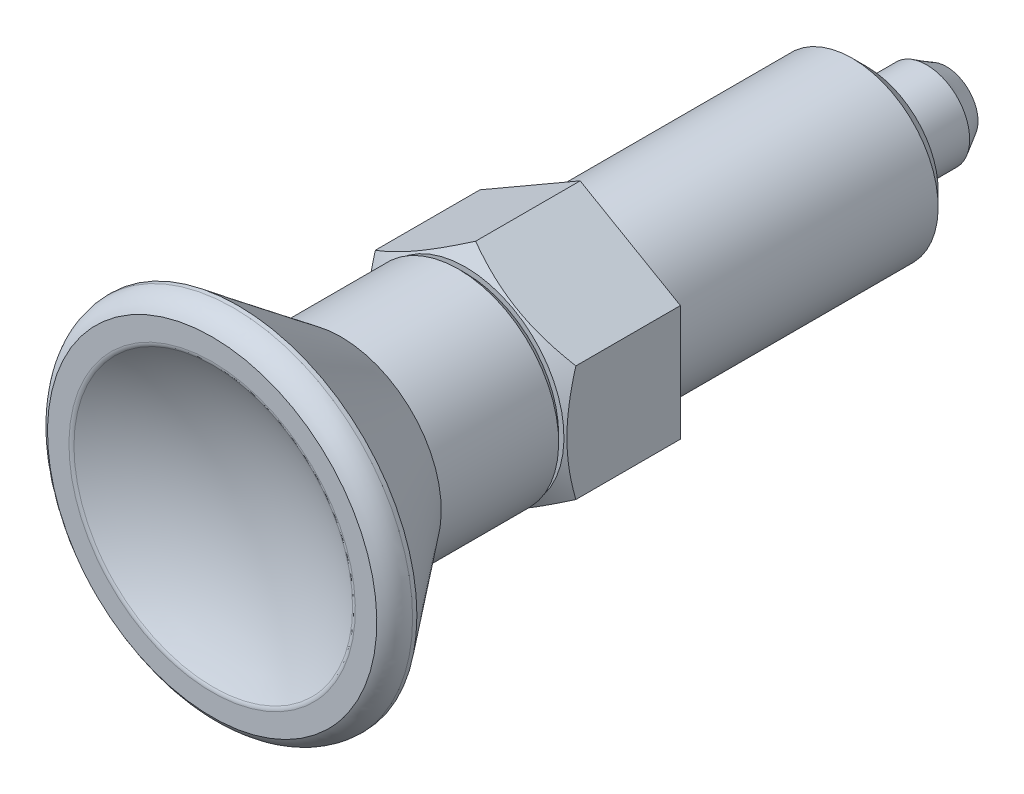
ISO-10303-21;
HEADER;
FILE_DESCRIPTION(('STEP AP214'),'2;1');
FILE_NAME('part.step','',(''),(''),'','','');
FILE_SCHEMA(('AUTOMOTIVE_DESIGN { 1 0 10303 214 1 1 1 1 }'));
ENDSEC;
DATA;
#1=APPLICATION_CONTEXT('core data for automotive mechanical design processes');
#2=APPLICATION_PROTOCOL_DEFINITION('international standard','automotive_design',2000,#1);
#3=PRODUCT_CONTEXT('',#1,'mechanical');
#4=PRODUCT('Part','Part','',(#3));
#5=PRODUCT_RELATED_PRODUCT_CATEGORY('part','',(#4));
#6=PRODUCT_DEFINITION_FORMATION('','',#4);
#7=PRODUCT_DEFINITION_CONTEXT('part definition',#1,'design');
#8=PRODUCT_DEFINITION('design','',#6,#7);
#9=PRODUCT_DEFINITION_SHAPE('','',#8);
#10=(LENGTH_UNIT() NAMED_UNIT(*) SI_UNIT(.MILLI.,.METRE.));
#11=(NAMED_UNIT(*) PLANE_ANGLE_UNIT() SI_UNIT($,.RADIAN.));
#12=(NAMED_UNIT(*) SI_UNIT($,.STERADIAN.) SOLID_ANGLE_UNIT());
#13=UNCERTAINTY_MEASURE_WITH_UNIT(LENGTH_MEASURE(1.E-05),#10,'distance_accuracy_value','');
#14=(GEOMETRIC_REPRESENTATION_CONTEXT(3) GLOBAL_UNCERTAINTY_ASSIGNED_CONTEXT((#13)) GLOBAL_UNIT_ASSIGNED_CONTEXT((#10,
#11,#12)) REPRESENTATION_CONTEXT('',''));
#15=CARTESIAN_POINT('',(0.,0.,0.));
#16=DIRECTION('',(0.,0.,1.));
#17=DIRECTION('',(1.,0.,0.));
#18=AXIS2_PLACEMENT_3D('',#15,#16,#17);
#19=CARTESIAN_POINT('',(0.,0.,-20.));
#20=DIRECTION('',(0.,0.,1.));
#21=DIRECTION('',(0.,1.,0.));
#22=AXIS2_PLACEMENT_3D('',#19,#20,#21);
#23=CONICAL_SURFACE('',#22,5.,0.785398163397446);
#24=CARTESIAN_POINT('',(0.,0.,-19.));
#25=DIRECTION('',(0.,0.,1.));
#26=DIRECTION('',(0.,1.,0.));
#27=AXIS2_PLACEMENT_3D('',#24,#25,#26);
#28=CIRCLE('',#27,6.);
#29=CARTESIAN_POINT('',(0.,6.,-19.));
#30=VERTEX_POINT('',#29);
#31=EDGE_CURVE('E612',#30,#30,#28,.T.);
#32=ORIENTED_EDGE('',*,*,#31,.F.);
#33=EDGE_LOOP('',(#32));
#34=FACE_BOUND('',#33,.T.);
#35=CARTESIAN_POINT('',(0.,0.,-20.));
#36=DIRECTION('',(0.,0.,-1.));
#37=DIRECTION('',(0.,1.,0.));
#38=AXIS2_PLACEMENT_3D('',#35,#36,#37);
#39=CIRCLE('',#38,5.);
#40=CARTESIAN_POINT('',(0.,5.,-20.));
#41=VERTEX_POINT('',#40);
#42=EDGE_CURVE('E605',#41,#41,#39,.T.);
#43=ORIENTED_EDGE('',*,*,#42,.F.);
#44=EDGE_LOOP('',(#43));
#45=FACE_BOUND('',#44,.T.);
#46=ADVANCED_FACE('F14',(#34,#45),#23,.T.);
#47=CARTESIAN_POINT('',(0.,0.,0.));
#48=DIRECTION('',(0.,0.,-1.));
#49=DIRECTION('',(0.,1.,0.));
#50=AXIS2_PLACEMENT_3D('',#47,#48,#49);
#51=CYLINDRICAL_SURFACE('',#50,6.);
#52=CARTESIAN_POINT('',(0.,0.,0.));
#53=DIRECTION('',(0.,0.,1.));
#54=DIRECTION('',(0.,1.,0.));
#55=AXIS2_PLACEMENT_3D('',#52,#53,#54);
#56=CIRCLE('',#55,6.);
#57=CARTESIAN_POINT('',(0.,6.,0.));
#58=VERTEX_POINT('',#57);
#59=EDGE_CURVE('E647',#58,#58,#56,.T.);
#60=ORIENTED_EDGE('',*,*,#59,.F.);
#61=EDGE_LOOP('',(#60));
#62=FACE_BOUND('',#61,.T.);
#63=ORIENTED_EDGE('',*,*,#31,.T.);
#64=EDGE_LOOP('',(#63));
#65=FACE_BOUND('',#64,.T.);
#66=ADVANCED_FACE('F167',(#62,#65),#51,.T.);
#67=CARTESIAN_POINT('',(-9.35,-9.35,0.));
#68=DIRECTION('',(0.,0.,-1.));
#69=DIRECTION('',(0.,1.,0.));
#70=AXIS2_PLACEMENT_3D('',#67,#68,#69);
#71=PLANE('',#70);
#72=DIRECTION('',(0.,-1.,0.));
#73=VECTOR('',#72,1.);
#74=CARTESIAN_POINT('',(7.,4.04145188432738,0.));
#75=LINE('',#74,#73);
#76=CARTESIAN_POINT('',(7.,4.04145188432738,0.));
#77=VERTEX_POINT('',#76);
#78=CARTESIAN_POINT('',(7.,-4.04145188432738,0.));
#79=VERTEX_POINT('',#78);
#80=EDGE_CURVE('E619',#77,#79,#75,.T.);
#81=ORIENTED_EDGE('',*,*,#80,.T.);
#82=DIRECTION('',(-0.866025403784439,-0.5,0.));
#83=VECTOR('',#82,1.);
#84=CARTESIAN_POINT('',(7.,-4.04145188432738,0.));
#85=LINE('',#84,#83);
#86=CARTESIAN_POINT('',(0.,-8.08290376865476,0.));
#87=VERTEX_POINT('',#86);
#88=EDGE_CURVE('E97',#79,#87,#85,.T.);
#89=ORIENTED_EDGE('',*,*,#88,.T.);
#90=DIRECTION('',(-0.866025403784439,0.5,0.));
#91=VECTOR('',#90,1.);
#92=CARTESIAN_POINT('',(0.,-8.08290376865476,0.));
#93=LINE('',#92,#91);
#94=CARTESIAN_POINT('',(-7.,-4.04145188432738,0.));
#95=VERTEX_POINT('',#94);
#96=EDGE_CURVE('E81',#87,#95,#93,.T.);
#97=ORIENTED_EDGE('',*,*,#96,.T.);
#98=DIRECTION('',(0.,1.,0.));
#99=VECTOR('',#98,1.);
#100=CARTESIAN_POINT('',(-7.,-4.04145188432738,0.));
#101=LINE('',#100,#99);
#102=CARTESIAN_POINT('',(-7.,4.04145188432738,0.));
#103=VERTEX_POINT('',#102);
#104=EDGE_CURVE('E87',#95,#103,#101,.T.);
#105=ORIENTED_EDGE('',*,*,#104,.T.);
#106=DIRECTION('',(0.866025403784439,0.5,0.));
#107=VECTOR('',#106,1.);
#108=CARTESIAN_POINT('',(-7.,4.04145188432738,0.));
#109=LINE('',#108,#107);
#110=CARTESIAN_POINT('',(0.,8.08290376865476,0.));
#111=VERTEX_POINT('',#110);
#112=EDGE_CURVE('E39',#103,#111,#109,.T.);
#113=ORIENTED_EDGE('',*,*,#112,.T.);
#114=DIRECTION('',(0.866025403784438,-0.5,0.));
#115=VECTOR('',#114,1.);
#116=CARTESIAN_POINT('',(0.,8.08290376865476,0.));
#117=LINE('',#116,#115);
#118=EDGE_CURVE('E641',#111,#77,#117,.T.);
#119=ORIENTED_EDGE('',*,*,#118,.T.);
#120=EDGE_LOOP('',(#81,#89,#97,#105,#113,#119));
#121=FACE_BOUND('',#120,.T.);
#122=ORIENTED_EDGE('',*,*,#59,.T.);
#123=EDGE_LOOP('',(#122));
#124=FACE_BOUND('',#123,.T.);
#125=ADVANCED_FACE('F95',(#121,#124),#71,.T.);
#126=CARTESIAN_POINT('',(7.,-4.04145188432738,8.));
#127=DIRECTION('',(-1.,0.,0.));
#128=DIRECTION('',(0.,1.,0.));
#129=AXIS2_PLACEMENT_3D('',#126,#127,#128);
#130=PLANE('',#129);
#131=DIRECTION('',(0.,0.,-1.));
#132=VECTOR('',#131,1.);
#133=CARTESIAN_POINT('',(7.,-4.04145188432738,7.3));
#134=LINE('',#133,#132);
#135=CARTESIAN_POINT('',(7.,-4.04145188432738,7.3));
#136=VERTEX_POINT('',#135);
#137=EDGE_CURVE('E654',#136,#79,#134,.T.);
#138=ORIENTED_EDGE('',*,*,#137,.T.);
#139=ORIENTED_EDGE('',*,*,#80,.F.);
#140=DIRECTION('',(0.,0.,1.));
#141=VECTOR('',#140,1.);
#142=CARTESIAN_POINT('',(7.,4.04145188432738,0.));
#143=LINE('',#142,#141);
#144=CARTESIAN_POINT('',(7.,4.04145188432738,7.3));
#145=VERTEX_POINT('',#144);
#146=EDGE_CURVE('E112',#77,#145,#143,.T.);
#147=ORIENTED_EDGE('',*,*,#146,.T.);
#148=CARTESIAN_POINT('',(7.,-4.04145188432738,7.3));
#149=CARTESIAN_POINT('',(7.00000000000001,0.,8.46666666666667));
#150=CARTESIAN_POINT('',(7.,4.04145188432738,7.3));
#151=(BOUNDED_CURVE() B_SPLINE_CURVE(2,(#148,#149,#150),.UNSPECIFIED.,.F.,
.F.) B_SPLINE_CURVE_WITH_KNOTS((3,3),(0.,1.),
.UNSPECIFIED.) CURVE() GEOMETRIC_REPRESENTATION_ITEM() RATIONAL_B_SPLINE_CURVE((1.,
1.15470053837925,1.)) REPRESENTATION_ITEM(''));
#152=EDGE_CURVE('E584',#136,#145,#151,.T.);
#153=ORIENTED_EDGE('',*,*,#152,.F.);
#154=EDGE_LOOP('',(#138,#139,#147,#153));
#155=FACE_BOUND('',#154,.T.);
#156=ADVANCED_FACE('F184',(#155),#130,.F.);
#157=CARTESIAN_POINT('',(0.,-8.08290376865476,8.));
#158=DIRECTION('',(-0.5,0.866025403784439,0.));
#159=DIRECTION('',(0.866025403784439,0.5,0.));
#160=AXIS2_PLACEMENT_3D('',#157,#158,#159);
#161=PLANE('',#160);
#162=DIRECTION('',(0.,0.,-1.));
#163=VECTOR('',#162,1.);
#164=CARTESIAN_POINT('',(0.,-8.08290376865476,7.3));
#165=LINE('',#164,#163);
#166=CARTESIAN_POINT('',(0.,-8.08290376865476,7.3));
#167=VERTEX_POINT('',#166);
#168=EDGE_CURVE('E106',#167,#87,#165,.T.);
#169=ORIENTED_EDGE('',*,*,#168,.T.);
#170=ORIENTED_EDGE('',*,*,#88,.F.);
#171=ORIENTED_EDGE('',*,*,#137,.F.);
#172=CARTESIAN_POINT('',(0.,-8.08290376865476,7.3));
#173=CARTESIAN_POINT('',(3.5,-6.06217782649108,8.46666666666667));
#174=CARTESIAN_POINT('',(7.,-4.04145188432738,7.3));
#175=(BOUNDED_CURVE() B_SPLINE_CURVE(2,(#172,#173,#174),.UNSPECIFIED.,.F.,
.F.) B_SPLINE_CURVE_WITH_KNOTS((3,3),(0.,1.),
.UNSPECIFIED.) CURVE() GEOMETRIC_REPRESENTATION_ITEM() RATIONAL_B_SPLINE_CURVE((1.,
1.15470053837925,1.)) REPRESENTATION_ITEM(''));
#176=EDGE_CURVE('E577',#167,#136,#175,.T.);
#177=ORIENTED_EDGE('',*,*,#176,.F.);
#178=EDGE_LOOP('',(#169,#170,#171,#177));
#179=FACE_BOUND('',#178,.T.);
#180=ADVANCED_FACE('F188',(#179),#161,.F.);
#181=CARTESIAN_POINT('',(-7.,-4.04145188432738,8.));
#182=DIRECTION('',(0.5,0.866025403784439,0.));
#183=DIRECTION('',(0.866025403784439,-0.5,0.));
#184=AXIS2_PLACEMENT_3D('',#181,#182,#183);
#185=PLANE('',#184);
#186=DIRECTION('',(0.,0.,-1.));
#187=VECTOR('',#186,1.);
#188=CARTESIAN_POINT('',(-7.,-4.04145188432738,7.3));
#189=LINE('',#188,#187);
#190=CARTESIAN_POINT('',(-7.,-4.04145188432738,7.3));
#191=VERTEX_POINT('',#190);
#192=EDGE_CURVE('E90',#191,#95,#189,.T.);
#193=ORIENTED_EDGE('',*,*,#192,.T.);
#194=ORIENTED_EDGE('',*,*,#96,.F.);
#195=ORIENTED_EDGE('',*,*,#168,.F.);
#196=CARTESIAN_POINT('',(-7.,-4.04145188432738,7.3));
#197=CARTESIAN_POINT('',(-3.5,-6.06217782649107,8.46666666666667));
#198=CARTESIAN_POINT('',(0.,-8.08290376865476,7.3));
#199=(BOUNDED_CURVE() B_SPLINE_CURVE(2,(#196,#197,#198),.UNSPECIFIED.,.F.,
.F.) B_SPLINE_CURVE_WITH_KNOTS((3,3),(0.,1.),
.UNSPECIFIED.) CURVE() GEOMETRIC_REPRESENTATION_ITEM() RATIONAL_B_SPLINE_CURVE((1.,
1.15470053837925,1.)) REPRESENTATION_ITEM(''));
#200=EDGE_CURVE('E103',#191,#167,#199,.T.);
#201=ORIENTED_EDGE('',*,*,#200,.F.);
#202=EDGE_LOOP('',(#193,#194,#195,#201));
#203=FACE_BOUND('',#202,.T.);
#204=ADVANCED_FACE('F101',(#203),#185,.F.);
#205=CARTESIAN_POINT('',(-7.,4.04145188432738,8.));
#206=DIRECTION('',(1.,0.,0.));
#207=DIRECTION('',(0.,-1.,0.));
#208=AXIS2_PLACEMENT_3D('',#205,#206,#207);
#209=PLANE('',#208);
#210=DIRECTION('',(0.,0.,-1.));
#211=VECTOR('',#210,1.);
#212=CARTESIAN_POINT('',(-7.,4.04145188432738,7.3));
#213=LINE('',#212,#211);
#214=CARTESIAN_POINT('',(-7.,4.04145188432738,7.3));
#215=VERTEX_POINT('',#214);
#216=EDGE_CURVE('E91',#215,#103,#213,.T.);
#217=ORIENTED_EDGE('',*,*,#216,.T.);
#218=ORIENTED_EDGE('',*,*,#104,.F.);
#219=ORIENTED_EDGE('',*,*,#192,.F.);
#220=CARTESIAN_POINT('',(-7.,4.04145188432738,7.3));
#221=CARTESIAN_POINT('',(-7.00000000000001,0.,8.46666666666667));
#222=CARTESIAN_POINT('',(-7.,-4.04145188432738,7.3));
#223=(BOUNDED_CURVE() B_SPLINE_CURVE(2,(#220,#221,#222),.UNSPECIFIED.,.F.,
.F.) B_SPLINE_CURVE_WITH_KNOTS((3,3),(0.,1.),
.UNSPECIFIED.) CURVE() GEOMETRIC_REPRESENTATION_ITEM() RATIONAL_B_SPLINE_CURVE((1.,
1.15470053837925,1.)) REPRESENTATION_ITEM(''));
#224=EDGE_CURVE('E566',#215,#191,#223,.T.);
#225=ORIENTED_EDGE('',*,*,#224,.F.);
#226=EDGE_LOOP('',(#217,#218,#219,#225));
#227=FACE_BOUND('',#226,.T.);
#228=ADVANCED_FACE('F88',(#227),#209,.F.);
#229=CARTESIAN_POINT('',(0.,8.08290376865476,8.));
#230=DIRECTION('',(0.5,-0.866025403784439,0.));
#231=DIRECTION('',(-0.866025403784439,-0.5,0.));
#232=AXIS2_PLACEMENT_3D('',#229,#230,#231);
#233=PLANE('',#232);
#234=DIRECTION('',(0.,0.,-1.));
#235=VECTOR('',#234,1.);
#236=CARTESIAN_POINT('',(0.,8.08290376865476,7.3));
#237=LINE('',#236,#235);
#238=CARTESIAN_POINT('',(0.,8.08290376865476,7.3));
#239=VERTEX_POINT('',#238);
#240=EDGE_CURVE('E120',#239,#111,#237,.T.);
#241=ORIENTED_EDGE('',*,*,#240,.T.);
#242=ORIENTED_EDGE('',*,*,#112,.F.);
#243=ORIENTED_EDGE('',*,*,#216,.F.);
#244=CARTESIAN_POINT('',(0.,8.08290376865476,7.3));
#245=CARTESIAN_POINT('',(-3.49999999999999,6.06217782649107,8.46666666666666));
#246=CARTESIAN_POINT('',(-7.,4.04145188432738,7.3));
#247=(BOUNDED_CURVE() B_SPLINE_CURVE(2,(#244,#245,#246),.UNSPECIFIED.,.F.,
.F.) B_SPLINE_CURVE_WITH_KNOTS((3,3),(0.,1.),
.UNSPECIFIED.) CURVE() GEOMETRIC_REPRESENTATION_ITEM() RATIONAL_B_SPLINE_CURVE((1.,
1.15470053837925,1.)) REPRESENTATION_ITEM(''));
#248=EDGE_CURVE('E559',#239,#215,#247,.T.);
#249=ORIENTED_EDGE('',*,*,#248,.F.);
#250=EDGE_LOOP('',(#241,#242,#243,#249));
#251=FACE_BOUND('',#250,.T.);
#252=ADVANCED_FACE('F197',(#251),#233,.F.);
#253=CARTESIAN_POINT('',(7.,4.04145188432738,8.));
#254=DIRECTION('',(-0.5,-0.866025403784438,0.));
#255=DIRECTION('',(-0.866025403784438,0.5,0.));
#256=AXIS2_PLACEMENT_3D('',#253,#254,#255);
#257=PLANE('',#256);
#258=ORIENTED_EDGE('',*,*,#146,.F.);
#259=ORIENTED_EDGE('',*,*,#118,.F.);
#260=ORIENTED_EDGE('',*,*,#240,.F.);
#261=CARTESIAN_POINT('',(7.,4.04145188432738,7.3));
#262=CARTESIAN_POINT('',(3.50000000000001,6.06217782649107,8.46666666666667));
#263=CARTESIAN_POINT('',(0.,8.08290376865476,7.3));
#264=(BOUNDED_CURVE() B_SPLINE_CURVE(2,(#261,#262,#263),.UNSPECIFIED.,.F.,
.F.) B_SPLINE_CURVE_WITH_KNOTS((3,3),(0.,1.),
.UNSPECIFIED.) CURVE() GEOMETRIC_REPRESENTATION_ITEM() RATIONAL_B_SPLINE_CURVE((1.,
1.15470053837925,1.)) REPRESENTATION_ITEM(''));
#265=EDGE_CURVE('E591',#145,#239,#264,.T.);
#266=ORIENTED_EDGE('',*,*,#265,.F.);
#267=EDGE_LOOP('',(#258,#259,#260,#266));
#268=FACE_BOUND('',#267,.T.);
#269=ADVANCED_FACE('F185',(#268),#257,.F.);
#270=CARTESIAN_POINT('',(0.,0.,8.5));
#271=DIRECTION('',(0.,0.,-1.));
#272=DIRECTION('',(0.,1.,0.));
#273=AXIS2_PLACEMENT_3D('',#270,#271,#272);
#274=CONICAL_SURFACE('',#273,6.00444279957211,1.0471975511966);
#275=CARTESIAN_POINT('',(0.,0.,8.));
#276=DIRECTION('',(0.,0.,1.));
#277=DIRECTION('',(0.,1.,0.));
#278=AXIS2_PLACEMENT_3D('',#275,#276,#277);
#279=CIRCLE('',#278,6.87046820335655);
#280=CARTESIAN_POINT('',(0.,6.87046820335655,8.));
#281=VERTEX_POINT('',#280);
#282=EDGE_CURVE('E598',#281,#281,#279,.T.);
#283=ORIENTED_EDGE('',*,*,#282,.F.);
#284=EDGE_LOOP('',(#283));
#285=FACE_BOUND('',#284,.T.);
#286=ORIENTED_EDGE('',*,*,#248,.T.);
#287=ORIENTED_EDGE('',*,*,#224,.T.);
#288=ORIENTED_EDGE('',*,*,#200,.T.);
#289=ORIENTED_EDGE('',*,*,#176,.T.);
#290=ORIENTED_EDGE('',*,*,#152,.T.);
#291=ORIENTED_EDGE('',*,*,#265,.T.);
#292=EDGE_LOOP('',(#286,#287,#288,#289,#290,#291));
#293=FACE_BOUND('',#292,.T.);
#294=ADVANCED_FACE('F200',(#285,#293),#274,.T.);
#295=CARTESIAN_POINT('',(9.35,-9.35,8.));
#296=DIRECTION('',(0.,0.,1.));
#297=DIRECTION('',(0.,1.,0.));
#298=AXIS2_PLACEMENT_3D('',#295,#296,#297);
#299=PLANE('',#298);
#300=CARTESIAN_POINT('',(0.,0.,8.));
#301=DIRECTION('',(0.,0.,1.));
#302=DIRECTION('',(1.,0.,0.));
#303=AXIS2_PLACEMENT_3D('',#300,#301,#302);
#304=CIRCLE('',#303,6.5);
#305=CARTESIAN_POINT('',(6.5,0.,8.));
#306=VERTEX_POINT('',#305);
#307=EDGE_CURVE('E118',#306,#306,#304,.T.);
#308=ORIENTED_EDGE('',*,*,#307,.F.);
#309=EDGE_LOOP('',(#308));
#310=FACE_BOUND('',#309,.T.);
#311=ORIENTED_EDGE('',*,*,#282,.T.);
#312=EDGE_LOOP('',(#311));
#313=FACE_BOUND('',#312,.T.);
#314=ADVANCED_FACE('F179',(#310,#313),#299,.T.);
#315=CARTESIAN_POINT('',(0.,0.,8.));
#316=DIRECTION('',(0.,0.,1.));
#317=DIRECTION('',(0.,1.,0.));
#318=AXIS2_PLACEMENT_3D('',#315,#316,#317);
#319=CONICAL_SURFACE('',#318,6.5,0.785398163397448);
#320=CARTESIAN_POINT('',(0.,0.,8.5));
#321=DIRECTION('',(0.,0.,1.));
#322=DIRECTION('',(0.,1.,0.));
#323=AXIS2_PLACEMENT_3D('',#320,#321,#322);
#324=CIRCLE('',#323,7.);
#325=CARTESIAN_POINT('',(0.,6.99999999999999,8.5));
#326=VERTEX_POINT('',#325);
#327=EDGE_CURVE('E114',#326,#326,#324,.T.);
#328=ORIENTED_EDGE('',*,*,#327,.F.);
#329=EDGE_LOOP('',(#328));
#330=FACE_BOUND('',#329,.T.);
#331=ORIENTED_EDGE('',*,*,#307,.T.);
#332=EDGE_LOOP('',(#331));
#333=FACE_BOUND('',#332,.T.);
#334=ADVANCED_FACE('F419',(#330,#333),#319,.T.);
#335=CARTESIAN_POINT('',(0.,0.,16.7));
#336=DIRECTION('',(0.,0.,-1.));
#337=DIRECTION('',(0.,1.,0.));
#338=AXIS2_PLACEMENT_3D('',#335,#336,#337);
#339=CYLINDRICAL_SURFACE('',#338,7.);
#340=ORIENTED_EDGE('',*,*,#327,.T.);
#341=EDGE_LOOP('',(#340));
#342=FACE_BOUND('',#341,.T.);
#343=CARTESIAN_POINT('',(0.,0.,16.7));
#344=DIRECTION('',(0.,0.,-1.));
#345=DIRECTION('',(0.,1.,0.));
#346=AXIS2_PLACEMENT_3D('',#343,#344,#345);
#347=CIRCLE('',#346,7.);
#348=CARTESIAN_POINT('',(0.,7.,16.7));
#349=VERTEX_POINT('',#348);
#350=EDGE_CURVE('E679',#349,#349,#347,.T.);
#351=ORIENTED_EDGE('',*,*,#350,.T.);
#352=EDGE_LOOP('',(#351));
#353=FACE_BOUND('',#352,.T.);
#354=ADVANCED_FACE('F489',(#342,#353),#339,.T.);
#355=CARTESIAN_POINT('',(0.,0.,16.7));
#356=DIRECTION('',(0.,0.,1.));
#357=DIRECTION('',(0.,1.,0.));
#358=AXIS2_PLACEMENT_3D('',#355,#356,#357);
#359=CONICAL_SURFACE('',#358,7.,0.652330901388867);
#360=CARTESIAN_POINT('',(0.,0.,23.9000000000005));
#361=DIRECTION('',(0.,0.,-1.));
#362=DIRECTION('',(0.,1.,0.));
#363=AXIS2_PLACEMENT_3D('',#360,#361,#362);
#364=CIRCLE('',#363,12.5);
#365=CARTESIAN_POINT('',(0.,12.5,23.9000000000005));
#366=VERTEX_POINT('',#365);
#367=EDGE_CURVE('E686',#366,#366,#364,.T.);
#368=ORIENTED_EDGE('',*,*,#367,.T.);
#369=EDGE_LOOP('',(#368));
#370=FACE_BOUND('',#369,.T.);
#371=ORIENTED_EDGE('',*,*,#350,.F.);
#372=EDGE_LOOP('',(#371));
#373=FACE_BOUND('',#372,.T.);
#374=ADVANCED_FACE('F477',(#370,#373),#359,.T.);
#375=CARTESIAN_POINT('',(0.,0.,24.200000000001));
#376=DIRECTION('',(0.,0.,-1.));
#377=DIRECTION('',(0.,1.,0.));
#378=AXIS2_PLACEMENT_3D('',#375,#376,#377);
#379=CYLINDRICAL_SURFACE('',#378,12.5);
#380=CARTESIAN_POINT('',(0.,0.,24.200000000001));
#381=DIRECTION('',(0.,0.,-1.));
#382=DIRECTION('',(0.,1.,0.));
#383=AXIS2_PLACEMENT_3D('',#380,#381,#382);
#384=CIRCLE('',#383,12.5);
#385=CARTESIAN_POINT('',(0.,12.5,24.200000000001));
#386=VERTEX_POINT('',#385);
#387=EDGE_CURVE('E693',#386,#386,#384,.T.);
#388=ORIENTED_EDGE('',*,*,#387,.T.);
#389=EDGE_LOOP('',(#388));
#390=FACE_BOUND('',#389,.T.);
#391=ORIENTED_EDGE('',*,*,#367,.F.);
#392=EDGE_LOOP('',(#391));
#393=FACE_BOUND('',#392,.T.);
#394=ADVANCED_FACE('F465',(#390,#393),#379,.T.);
#395=CARTESIAN_POINT('',(0.,11.4999999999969,25.7000000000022));
#396=CARTESIAN_POINT('',(0.,12.3786586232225,25.2024390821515));
#397=CARTESIAN_POINT('',(0.,12.5,24.200000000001));
#398=CARTESIAN_POINT('',(19.9185842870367,11.4999999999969,25.7000000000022));
#399=CARTESIAN_POINT('',(21.440465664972,12.3786586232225,25.2024390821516));
#400=CARTESIAN_POINT('',(21.6506350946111,12.5,24.200000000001));
#401=CARTESIAN_POINT('',(9.95929214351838,-5.74999999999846,25.7000000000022));
#402=CARTESIAN_POINT('',(10.720232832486,-6.18932931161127,25.2024390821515));
#403=CARTESIAN_POINT('',(10.8253175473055,-6.25,24.200000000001));
#404=CARTESIAN_POINT('',(0.,-22.9999999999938,25.7000000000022));
#405=CARTESIAN_POINT('',(0.,-24.7573172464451,25.2024390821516));
#406=CARTESIAN_POINT('',(0.,-25.,24.200000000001));
#407=CARTESIAN_POINT('',(-9.95929214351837,-5.74999999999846,25.7000000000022));
#408=CARTESIAN_POINT('',(-10.720232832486,-6.18932931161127,25.2024390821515));
#409=CARTESIAN_POINT('',(-10.8253175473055,-6.25,24.200000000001));
#410=CARTESIAN_POINT('',(-19.9185842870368,11.4999999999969,25.7000000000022));
#411=CARTESIAN_POINT('',(-21.440465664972,12.3786586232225,25.2024390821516));
#412=CARTESIAN_POINT('',(-21.6506350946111,12.5,24.200000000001));
#413=CARTESIAN_POINT('',(0.,11.4999999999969,25.7000000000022));
#414=CARTESIAN_POINT('',(0.,12.3786586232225,25.2024390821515));
#415=CARTESIAN_POINT('',(0.,12.5,24.200000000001));
#416=(BOUNDED_SURFACE() B_SPLINE_SURFACE(2,2,((#395,#396,#397),(#398,#399,#400),(#401,#402,
#403),(#404,#405,#406),(#407,#408,#409),(#410,#411,#412),(#413,#414,#415)),.UNSPECIFIED.,.T.,
.F.,.F.) B_SPLINE_SURFACE_WITH_KNOTS((3,2,2,3),(3,3),(0.,20.8901320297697,41.7802640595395,
62.6703960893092),(0.,1.),
.UNSPECIFIED.) GEOMETRIC_REPRESENTATION_ITEM() RATIONAL_B_SPLINE_SURFACE(((1.,0.89267855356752,
1.),(0.5,0.44633927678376,0.5),(1.,0.89267855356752,1.),(0.5,0.44633927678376,0.5),(1.,
0.89267855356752,1.),(0.5,0.44633927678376,0.5),(1.,0.89267855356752,1.))) REPRESENTATION_ITEM('') SURFACE());
#417=CARTESIAN_POINT('',(0.,0.,25.7000000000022));
#418=DIRECTION('',(0.,0.,-1.));
#419=DIRECTION('',(0.,1.,0.));
#420=AXIS2_PLACEMENT_3D('',#417,#418,#419);
#421=CIRCLE('',#420,11.4999999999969);
#422=CARTESIAN_POINT('',(0.,11.4999999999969,25.7000000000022));
#423=VERTEX_POINT('',#422);
#424=EDGE_CURVE('E700',#423,#423,#421,.T.);
#425=CARTESIAN_POINT('',(0.,11.4999999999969,25.7000000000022));
#426=CARTESIAN_POINT('',(0.,11.5040886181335,25.6976847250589));
#427=CARTESIAN_POINT('',(0.,11.5081690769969,25.6953550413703));
#428=CARTESIAN_POINT('',(0.,11.516320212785,25.6906630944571));
#429=CARTESIAN_POINT('',(0.,11.5203908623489,25.6883007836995));
#430=CARTESIAN_POINT('',(0.,11.5285220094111,25.6835436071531));
#431=CARTESIAN_POINT('',(0.,11.5325824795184,25.6811486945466));
#432=CARTESIAN_POINT('',(0.,11.5406928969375,25.6763263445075));
#433=CARTESIAN_POINT('',(0.,11.5447428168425,25.673898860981));
#434=CARTESIAN_POINT('',(0.,11.5528317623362,25.6690114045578));
#435=CARTESIAN_POINT('',(0.,11.5568707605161,25.6665513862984));
#436=CARTESIAN_POINT('',(0.,11.5649374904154,25.6615989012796));
#437=CARTESIAN_POINT('',(0.,11.5689651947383,25.6591063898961));
#438=CARTESIAN_POINT('',(0.,11.577008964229,25.6540889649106));
#439=CARTESIAN_POINT('',(0.,11.581025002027,25.6515640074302));
#440=CARTESIAN_POINT('',(0.,11.5890450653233,25.6464817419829));
#441=CARTESIAN_POINT('',(0.,11.5930490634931,25.6439243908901));
#442=CARTESIAN_POINT('',(0.,11.6010446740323,25.638777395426));
#443=CARTESIAN_POINT('',(0.,11.605036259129,25.6361877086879));
#444=CARTESIAN_POINT('',(0.,11.6130066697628,25.6309761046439));
#445=CARTESIAN_POINT('',(0.,11.6169854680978,25.6283541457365));
#446=CARTESIAN_POINT('',(0.,11.6249299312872,25.6230780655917));
#447=CARTESIAN_POINT('',(0.,11.6288955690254,25.6204239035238));
#448=CARTESIAN_POINT('',(0.,11.6368133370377,25.6150834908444));
#449=CARTESIAN_POINT('',(0.,11.6407654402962,25.6123972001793));
#450=CARTESIAN_POINT('',(0.,11.6486557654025,25.606992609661));
#451=CARTESIAN_POINT('',(0.,11.6525939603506,25.6042742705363));
#452=CARTESIAN_POINT('',(0.,11.6604560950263,25.5988056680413));
#453=CARTESIAN_POINT('',(0.,11.6643800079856,25.5960553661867));
#454=CARTESIAN_POINT('',(0.,11.6722132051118,25.5905229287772));
#455=CARTESIAN_POINT('',(0.,11.6761224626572,25.5877407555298));
#456=CARTESIAN_POINT('',(0.,11.6839259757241,25.5821446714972));
#457=CARTESIAN_POINT('',(0.,11.6878202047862,25.5793307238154));
#458=CARTESIAN_POINT('',(0.,11.6955932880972,25.5736711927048));
#459=CARTESIAN_POINT('',(0.,11.6994721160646,25.5708255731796));
#460=CARTESIAN_POINT('',(0.,11.7072140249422,25.5651028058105));
#461=CARTESIAN_POINT('',(0.,11.7110770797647,25.5622256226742));
#462=CARTESIAN_POINT('',(0.,11.718787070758,25.5564398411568));
#463=CARTESIAN_POINT('',(0.,11.7226339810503,25.5535312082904));
#464=CARTESIAN_POINT('',(0.,11.7303113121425,25.5476826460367));
#465=CARTESIAN_POINT('',(0.,11.734141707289,25.5447426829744));
#466=CARTESIAN_POINT('',(0.,11.7417856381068,25.5388315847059));
#467=CARTESIAN_POINT('',(0.,11.7455991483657,25.5358604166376));
#468=CARTESIAN_POINT('',(0.,11.7532089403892,25.5298870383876));
#469=CARTESIAN_POINT('',(0.,11.7570051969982,25.5268847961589));
#470=CARTESIAN_POINT('',(0.,11.7645801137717,25.5208494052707));
#471=CARTESIAN_POINT('',(0.,11.7683587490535,25.5178162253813));
#472=CARTESIAN_POINT('',(0.,11.7758980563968,25.5117191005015));
#473=CARTESIAN_POINT('',(0.,11.7796587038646,25.5086551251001));
#474=CARTESIAN_POINT('',(0.,11.7871616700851,25.5024965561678));
#475=CARTESIAN_POINT('',(0.,11.7909039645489,25.4994019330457));
#476=CARTESIAN_POINT('',(0.,11.7983698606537,25.493182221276));
#477=CARTESIAN_POINT('',(0.,11.8020934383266,25.4900571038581));
#478=CARTESIAN_POINT('',(0.,11.8095215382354,25.4837765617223));
#479=CARTESIAN_POINT('',(0.,11.81322603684,25.4806211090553));
#480=CARTESIAN_POINT('',(0.,11.8206156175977,25.4742800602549));
#481=CARTESIAN_POINT('',(0.,11.8243006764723,25.4710944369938));
#482=CARTESIAN_POINT('',(0.,11.8316510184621,25.4646932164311));
#483=CARTESIAN_POINT('',(0.,11.8353162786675,25.4614775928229));
#484=CARTESIAN_POINT('',(0.,11.8426266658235,25.4550165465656));
#485=CARTESIAN_POINT('',(0.,11.8462717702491,25.4517710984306));
#486=CARTESIAN_POINT('',(0.,11.8535414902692,25.4452505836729));
#487=CARTESIAN_POINT('',(0.,11.8571660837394,25.4419754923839));
#488=CARTESIAN_POINT('',(0.,11.8643944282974,25.4353958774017));
#489=CARTESIAN_POINT('',(0.,11.8679981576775,25.4320913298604));
#490=CARTESIAN_POINT('',(0.,11.8751844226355,25.4254529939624));
#491=CARTESIAN_POINT('',(0.,11.8787669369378,25.4221191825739));
#492=CARTESIAN_POINT('',(0.,11.8859104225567,25.4154225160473));
#493=CARTESIAN_POINT('',(0.,11.8894713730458,25.4120596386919));
#494=CARTESIAN_POINT('',(0.,11.896571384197,25.4053050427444));
#495=CARTESIAN_POINT('',(0.,11.9001104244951,25.4019133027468));
#496=CARTESIAN_POINT('',(0.,11.9071662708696,25.3951011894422));
#497=CARTESIAN_POINT('',(0.,11.9106830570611,25.3916807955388));
#498=CARTESIAN_POINT('',(0.,11.9176940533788,25.3848115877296));
#499=CARTESIAN_POINT('',(0.,11.9211882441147,25.3813627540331));
#500=CARTESIAN_POINT('',(0.,11.9281537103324,25.3744368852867));
#501=CARTESIAN_POINT('',(0.,11.9316249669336,25.3709598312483));
#502=CARTESIAN_POINT('',(0.,11.9385442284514,25.3639777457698));
#503=CARTESIAN_POINT('',(0.,11.9419922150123,25.3604726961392));
#504=CARTESIAN_POINT('',(0.,11.9488646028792,25.3534348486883));
#505=CARTESIAN_POINT('',(0.,11.9522889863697,25.3499020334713));
#506=CARTESIAN_POINT('',(0.,11.9591138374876,25.3428088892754));
#507=CARTESIAN_POINT('',(0.,11.9625142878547,25.339248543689));
#508=CARTESIAN_POINT('',(0.,11.9692909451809,25.3321005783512));
#509=CARTESIAN_POINT('',(0.,11.9726671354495,25.3285129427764));
#510=CARTESIAN_POINT('',(0.,11.9793949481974,25.321310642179));
#511=CARTESIAN_POINT('',(0.,11.9827465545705,25.3176959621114));
#512=CARTESIAN_POINT('',(0.,11.9894248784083,25.3104398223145));
#513=CARTESIAN_POINT('',(0.,11.9927515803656,25.3067983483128));
#514=CARTESIAN_POINT('',(0.,11.9993797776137,25.2994888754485));
#515=CARTESIAN_POINT('',(0.,12.0026812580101,25.29582086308));
#516=CARTESIAN_POINT('',(0.,12.0092586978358,25.2884585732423));
#517=CARTESIAN_POINT('',(0.,12.0125346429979,25.284764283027));
#518=CARTESIAN_POINT('',(0.,12.0190607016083,25.2773497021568));
#519=CARTESIAN_POINT('',(0.,12.0223108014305,25.2736293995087));
#520=CARTESIAN_POINT('',(0.,12.0287848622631,25.2661630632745));
#521=CARTESIAN_POINT('',(0.,12.0320088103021,25.2624170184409));
#522=CARTESIAN_POINT('',(0.,12.0384302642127,25.2548994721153));
#523=CARTESIAN_POINT('',(0.,12.041627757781,25.2511279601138));
#524=CARTESIAN_POINT('',(0.,12.0479960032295,25.2435597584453));
#525=CARTESIAN_POINT('',(0.,12.0511667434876,25.239763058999));
#526=CARTESIAN_POINT('',(0.,12.0574811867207,25.2321447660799));
#527=CARTESIAN_POINT('',(0.,12.0606248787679,25.2283231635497));
#528=CARTESIAN_POINT('',(0.,12.0668849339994,25.2206553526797));
#529=CARTESIAN_POINT('',(0.,12.070001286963,25.2168091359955));
#530=CARTESIAN_POINT('',(0.,12.0762063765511,25.2090923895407));
#531=CARTESIAN_POINT('',(0.,12.0792951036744,25.2052218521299));
#532=CARTESIAN_POINT('',(0.,12.0854446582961,25.1974567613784));
#533=CARTESIAN_POINT('',(0.,12.0885054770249,25.1935622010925));
#534=CARTESIAN_POINT('',(0.,12.094598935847,25.1857493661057));
#535=CARTESIAN_POINT('',(0.,12.0976315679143,25.1818310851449));
#536=CARTESIAN_POINT('',(0.,12.1036683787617,25.1739711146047));
#537=CARTESIAN_POINT('',(0.,12.106672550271,25.1700294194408));
#538=CARTESIAN_POINT('',(0.,12.1126521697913,25.1621229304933));
#539=CARTESIAN_POINT('',(0.,12.1156276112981,25.1581581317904));
#540=CARTESIAN_POINT('',(0.,12.1215495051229,25.1502057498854));
#541=CARTESIAN_POINT('',(0.,12.1244959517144,25.1462181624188));
#542=CARTESIAN_POINT('',(0.,12.1303595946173,25.1382205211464));
#543=CARTESIAN_POINT('',(0.,12.1332767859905,25.13421046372));
#544=CARTESIAN_POINT('',(0.,12.1390816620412,25.1261682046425));
#545=CARTESIAN_POINT('',(0.,12.1419693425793,25.1221360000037));
#546=CARTESIAN_POINT('',(0.,12.1477149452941,25.1140497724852));
#547=CARTESIAN_POINT('',(0.,12.1505728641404,25.1099957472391));
#548=CARTESIAN_POINT('',(0.,12.1562586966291,25.1018662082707));
#549=CARTESIAN_POINT('',(0.,12.1590866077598,25.0977906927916));
#550=CARTESIAN_POINT('',(0.,12.1647121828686,25.0896185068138));
#551=CARTESIAN_POINT('',(0.,12.1675098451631,25.0855218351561));
#552=CARTESIAN_POINT('',(0.,12.1730746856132,25.0773076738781));
#553=CARTESIAN_POINT('',(0.,12.1758418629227,25.0731901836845));
#554=CARTESIAN_POINT('',(0.,12.1813455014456,25.0649347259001));
#555=CARTESIAN_POINT('',(0.,12.1840819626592,25.0607967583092));
#556=CARTESIAN_POINT('',(0.,12.1895239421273,25.0525006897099));
#557=CARTESIAN_POINT('',(0.,12.1922294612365,25.048342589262));
#558=CARTESIAN_POINT('',(0.,12.1976093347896,25.040006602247));
#559=CARTESIAN_POINT('',(0.,12.2002836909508,25.0358287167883));
#560=CARTESIAN_POINT('',(0.,12.2056010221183,25.0274535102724));
#561=CARTESIAN_POINT('',(0.,12.2082439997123,25.0232561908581));
#562=CARTESIAN_POINT('',(0.,12.2134983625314,25.0148424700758));
#563=CARTESIAN_POINT('',(0.,12.2161097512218,25.0106260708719));
#564=CARTESIAN_POINT('',(0.,12.2213007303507,25.0021745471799));
#565=CARTESIAN_POINT('',(0.,12.2238803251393,24.9979394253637));
#566=CARTESIAN_POINT('',(0.,12.2290075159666,24.9894508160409));
#567=CARTESIAN_POINT('',(0.,12.2315551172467,24.9851973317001));
#568=CARTESIAN_POINT('',(0.,12.2366181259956,24.9766723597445));
#569=CARTESIAN_POINT('',(0.,12.2391335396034,24.9724008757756));
#570=CARTESIAN_POINT('',(0.,12.2441319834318,24.9638402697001));
#571=CARTESIAN_POINT('',(0.,12.2466150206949,24.9595511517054));
#572=CARTESIAN_POINT('',(0.,12.2515485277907,24.9509556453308));
#573=CARTESIAN_POINT('',(0.,12.2539990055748,24.9466492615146));
#574=CARTESIAN_POINT('',(0.,12.2588672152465,24.9380195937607));
#575=CARTESIAN_POINT('',(0.,12.2612849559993,24.9336963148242));
#576=CARTESIAN_POINT('',(0.,12.2660875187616,24.9250332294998));
#577=CARTESIAN_POINT('',(0.,12.2684723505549,24.9206934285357));
#578=CARTESIAN_POINT('',(0.,12.2732089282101,24.9119976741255));
#579=CARTESIAN_POINT('',(0.,12.2755606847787,24.9076417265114));
#580=CARTESIAN_POINT('',(0.,12.2802309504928,24.8989140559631));
#581=CARTESIAN_POINT('',(0.,12.2825494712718,24.8945423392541));
#582=CARTESIAN_POINT('',(0.,12.2871531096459,24.8857835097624));
#583=CARTESIAN_POINT('',(0.,12.2894382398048,24.8813964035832));
#584=CARTESIAN_POINT('',(0.,12.2939749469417,24.8726071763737));
#585=CARTESIAN_POINT('',(0.,12.2962265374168,24.8682050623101));
#586=CARTESIAN_POINT('',(0.,12.3006960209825,24.8593862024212));
#587=CARTESIAN_POINT('',(0.,12.3029139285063,24.8549694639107));
#588=CARTESIAN_POINT('',(0.,12.3073159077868,24.8461217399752));
#589=CARTESIAN_POINT('',(0.,12.309499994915,24.8416907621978));
#590=CARTESIAN_POINT('',(0.,12.3138342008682,24.8328149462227));
#591=CARTESIAN_POINT('',(0.,12.3159843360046,24.8283701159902));
#592=CARTESIAN_POINT('',(0.,12.3202505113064,24.8194669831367));
#593=CARTESIAN_POINT('',(0.,12.3223665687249,24.8150086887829));
#594=CARTESIAN_POINT('',(0.,12.3265644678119,24.8060790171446));
#595=CARTESIAN_POINT('',(0.,12.3286463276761,24.801607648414));
#596=CARTESIAN_POINT('',(0.,12.3327757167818,24.7926522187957));
#597=CARTESIAN_POINT('',(0.,12.3348232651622,24.788168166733));
#598=CARTESIAN_POINT('',(0.,12.3388839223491,24.7791877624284));
#599=CARTESIAN_POINT('',(0.,12.340897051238,24.774691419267));
#600=CARTESIAN_POINT('',(0.,12.3448887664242,24.765686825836));
#601=CARTESIAN_POINT('',(0.,12.3468673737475,24.761178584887));
#602=CARTESIAN_POINT('',(0.,12.3507899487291,24.7521505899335));
#603=CARTESIAN_POINT('',(0.,12.3527339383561,24.7476308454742));
#604=CARTESIAN_POINT('',(0.,12.3565871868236,24.7385802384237));
#605=CARTESIAN_POINT('',(0.,12.3584964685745,24.7340493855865));
#606=CARTESIAN_POINT('',(0.,12.3622802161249,24.724976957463));
#607=CARTESIAN_POINT('',(0.,12.3641547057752,24.7204353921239));
#608=CARTESIAN_POINT('',(0.,12.3678687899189,24.7113419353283));
#609=CARTESIAN_POINT('',(0.,12.3697084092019,24.7067900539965));
#610=CARTESIAN_POINT('',(0.,12.3733526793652,24.6976763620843));
#611=CARTESIAN_POINT('',(0.,12.3751573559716,24.6931145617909));
#612=CARTESIAN_POINT('',(0.,12.3787316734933,24.6839814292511));
#613=CARTESIAN_POINT('',(0.,12.3805013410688,24.6794101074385));
#614=CARTESIAN_POINT('',(0.,12.384005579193,24.6702583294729));
#615=CARTESIAN_POINT('',(0.,12.385740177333,24.6656778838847));
#616=CARTESIAN_POINT('',(0.,12.3891742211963,24.6565082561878));
#617=CARTESIAN_POINT('',(0.,12.3908736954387,24.6519190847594));
#618=CARTESIAN_POINT('',(0.,12.3942374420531,24.6427324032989));
#619=CARTESIAN_POINT('',(0.,12.3959017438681,24.6381349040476));
#620=CARTESIAN_POINT('',(0.,12.3991951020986,24.628931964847));
#621=CARTESIAN_POINT('',(0.,12.4008241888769,24.6243265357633));
#622=CARTESIAN_POINT('',(0.,12.4040470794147,24.6151081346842));
#623=CARTESIAN_POINT('',(0.,12.4056409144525,24.610495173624));
#624=CARTESIAN_POINT('',(0.,12.4087932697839,24.6012621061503));
#625=CARTESIAN_POINT('',(0.,12.4103518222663,24.5966420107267));
#626=CARTESIAN_POINT('',(0.,12.4134335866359,24.5873950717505));
#627=CARTESIAN_POINT('',(0.,12.4149568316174,24.5827682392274));
#628=CARTESIAN_POINT('',(0.,12.4179679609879,24.5735082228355));
#629=CARTESIAN_POINT('',(0.,12.4194558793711,24.5688750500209));
#630=CARTESIAN_POINT('',(0.,12.4223963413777,24.5596027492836));
#631=CARTESIAN_POINT('',(0.,12.4238489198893,24.5549636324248));
#632=CARTESIAN_POINT('',(0.,12.4267186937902,24.5456798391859));
#633=CARTESIAN_POINT('',(0.,12.4281359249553,24.5410351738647));
#634=CARTESIAN_POINT('',(0.,12.4309350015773,24.5317406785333));
#635=CARTESIAN_POINT('',(0.,12.432316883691,24.5270908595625));
#636=CARTESIAN_POINT('',(0.,12.435045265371,24.5177864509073));
#637=CARTESIAN_POINT('',(0.,12.4363918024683,24.5131318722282));
#638=CARTESIAN_POINT('',(0.,12.4390495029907,24.5038183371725));
#639=CARTESIAN_POINT('',(0.,12.4403607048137,24.4991593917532));
#640=CARTESIAN_POINT('',(0.,12.4429477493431,24.4898375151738));
#641=CARTESIAN_POINT('',(0.,12.4442236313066,24.4851745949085));
#642=CARTESIAN_POINT('',(0.,12.4467400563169,24.475845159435));
#643=CARTESIAN_POINT('',(0.,12.4479806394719,24.4711786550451));
#644=CARTESIAN_POINT('',(0.,12.4504264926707,24.4618424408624));
#645=CARTESIAN_POINT('',(0.,12.4516318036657,24.4571727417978));
#646=CARTESIAN_POINT('',(0.,12.4540071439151,24.4478305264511));
#647=CARTESIAN_POINT('',(0.,12.4551772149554,24.4431580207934));
#648=CARTESIAN_POINT('',(0.,12.4574821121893,24.4338105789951));
#649=CARTESIAN_POINT('',(0.,12.4586169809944,24.4291356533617));
#650=CARTESIAN_POINT('',(0.,12.4608515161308,24.4197837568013));
#651=CARTESIAN_POINT('',(0.,12.46195122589,24.415106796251));
#652=CARTESIAN_POINT('',(0.,12.4641154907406,24.4057512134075));
#653=CARTESIAN_POINT('',(0.,12.4651800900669,24.4010726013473));
#654=CARTESIAN_POINT('',(0.,12.4672741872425,24.3917140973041));
#655=CARTESIAN_POINT('',(0.,12.468303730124,24.3870342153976));
#656=CARTESIAN_POINT('',(0.,12.4703277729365,24.3776735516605));
#657=CARTESIAN_POINT('',(0.,12.4713223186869,24.3729927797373));
#658=CARTESIAN_POINT('',(0.,12.4732764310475,24.3636307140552));
#659=CARTESIAN_POINT('',(0.,12.4742360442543,24.3589494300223));
#660=CARTESIAN_POINT('',(0.,12.4761203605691,24.3495867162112));
#661=CARTESIAN_POINT('',(0.,12.4770451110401,24.3449052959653));
#662=CARTESIAN_POINT('',(0.,12.478859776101,24.3355426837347));
#663=CARTESIAN_POINT('',(0.,12.4797497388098,24.3308615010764));
#664=CARTESIAN_POINT('',(0.,12.4814949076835,24.3214997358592));
#665=CARTESIAN_POINT('',(0.,12.4823501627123,24.316819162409));
#666=CARTESIAN_POINT('',(0.,12.4840260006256,24.3074589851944));
#667=CARTESIAN_POINT('',(0.,12.4848466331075,24.3027793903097));
#668=CARTESIAN_POINT('',(0.,12.4864533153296,24.2934215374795));
#669=CARTESIAN_POINT('',(0.,12.4872394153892,24.2887432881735));
#670=CARTESIAN_POINT('',(0.,12.4887771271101,24.2793884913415));
#671=CARTESIAN_POINT('',(0.,12.4895287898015,24.2747119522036));
#672=CARTESIAN_POINT('',(0.,12.4909977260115,24.2653609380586));
#673=CARTESIAN_POINT('',(0.,12.4917150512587,24.2606864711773));
#674=CARTESIAN_POINT('',(0.,12.4931154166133,24.2513399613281));
#675=CARTESIAN_POINT('',(0.,12.4937985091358,24.2466679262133));
#676=CARTESIAN_POINT('',(0.,12.4951305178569,24.2373266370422));
#677=CARTESIAN_POINT('',(0.,12.4957794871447,24.232657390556));
#678=CARTESIAN_POINT('',(0.,12.4970433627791,24.2233220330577));
#679=CARTESIAN_POINT('',(0.,12.4976583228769,24.2186559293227));
#680=CARTESIAN_POINT('',(0.,12.4988542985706,24.2093272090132));
#681=CARTESIAN_POINT('',(0.,12.4994353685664,24.2046645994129));
#682=CARTESIAN_POINT('',(0.,12.5,24.200000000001));
#683=B_SPLINE_CURVE_WITH_KNOTS('',3,(#425,#426,#427,#428,#429,#430,#431,#432,#433,#434,#435,
#436,#437,#438,#439,#440,#441,#442,#443,#444,#445,#446,#447,#448,#449,#450,#451,#452,#453,#454,
#455,#456,#457,#458,#459,#460,#461,#462,#463,#464,#465,#466,#467,#468,#469,#470,#471,#472,#473,
#474,#475,#476,#477,#478,#479,#480,#481,#482,#483,#484,#485,#486,#487,#488,#489,#490,#491,#492,
#493,#494,#495,#496,#497,#498,#499,#500,#501,#502,#503,#504,#505,#506,#507,#508,#509,#510,#511,
#512,#513,#514,#515,#516,#517,#518,#519,#520,#521,#522,#523,#524,#525,#526,#527,#528,#529,#530,
#531,#532,#533,#534,#535,#536,#537,#538,#539,#540,#541,#542,#543,#544,#545,#546,#547,#548,#549,
#550,#551,#552,#553,#554,#555,#556,#557,#558,#559,#560,#561,#562,#563,#564,#565,#566,#567,#568,
#569,#570,#571,#572,#573,#574,#575,#576,#577,#578,#579,#580,#581,#582,#583,#584,#585,#586,#587,
#588,#589,#590,#591,#592,#593,#594,#595,#596,#597,#598,#599,#600,#601,#602,#603,#604,#605,#606,
#607,#608,#609,#610,#611,#612,#613,#614,#615,#616,#617,#618,#619,#620,#621,#622,#623,#624,#625,
#626,#627,#628,#629,#630,#631,#632,#633,#634,#635,#636,#637,#638,#639,#640,#641,#642,#643,#644,
#645,#646,#647,#648,#649,#650,#651,#652,#653,#654,#655,#656,#657,#658,#659,#660,#661,#662,#663,
#664,#665,#666,#667,#668,#669,#670,#671,#672,#673,#674,#675,#676,#677,#678,#679,#680,#681,#682),
.UNSPECIFIED.,.F.,.F.,(4,2,2,2,2,2,2,2,2,2,2,2,2,2,2,2,2,2,2,2,2,2,2,2,2,2,2,2,2,2,2,2,2,2,2,2,
2,2,2,2,2,2,2,2,2,2,2,2,2,2,2,2,2,2,2,2,2,2,2,2,2,2,2,2,2,2,2,2,2,2,2,2,2,2,2,2,2,2,2,2,2,2,2,2,
2,2,2,2,2,2,2,2,2,2,2,2,2,2,2,2,2,2,2,2,2,2,2,2,2,2,2,2,2,2,2,2,2,2,2,2,2,2,2,2,2,2,2,2,4),(0.,
0.0140959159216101,0.028215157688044,0.0423574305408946,0.056522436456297,0.0707098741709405,
0.0849194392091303,0.0991508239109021,0.113403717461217,0.127677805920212,0.141972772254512,
0.156288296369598,0.170624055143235,0.184979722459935,0.19935496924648,0.213749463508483,
0.228162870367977,0.242594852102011,0.257045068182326,0.271513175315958,0.285998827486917,
0.300501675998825,0.315021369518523,0.329557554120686,0.34410987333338,0.358677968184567,
0.373261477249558,0.387860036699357,0.402473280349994,0.417100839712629,0.43174234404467,
0.44639742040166,0.461065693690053,0.47574678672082,0.490440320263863,0.50514591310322,
0.519863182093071,0.53459174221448,0.549331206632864,0.56408118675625,0.578841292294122,
0.593611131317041,0.608390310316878,0.623178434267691,0.637975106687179,0.65277992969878,
0.667592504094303,0.682412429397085,0.697239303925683,0.712072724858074,0.726912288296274,
0.741757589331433,0.756608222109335,0.771463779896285,0.786323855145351,0.801188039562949,
0.816055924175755,0.830927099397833,0.845801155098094,0.860677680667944,0.875556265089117,
0.890436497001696,0.905317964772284,0.920200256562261,0.935082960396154,0.949965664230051,
0.964847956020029,0.979729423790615,0.994609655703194,1.00948824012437,1.02436476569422,
1.03923882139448,1.05410999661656,1.06897788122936,1.08384206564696,1.09870214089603,
1.11355769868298,1.12840833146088,1.14325363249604,1.15809319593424,1.17292661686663,
1.18775349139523,1.20257341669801,1.21738599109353,1.23219081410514,1.24698748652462,
1.26177561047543,1.27655478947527,1.29132462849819,1.30608473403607,1.32083471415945,
1.33557417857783,1.35030273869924,1.36502000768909,1.37972560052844,1.39441913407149,
1.40910022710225,1.42376850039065,1.43842357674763,1.45306508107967,1.46769264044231,
1.48230588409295,1.49690444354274,1.51148795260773,1.52605604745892,1.54060836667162,
1.55514455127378,1.56966424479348,1.58416709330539,1.59865274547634,1.61312085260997,
1.62757106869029,1.64200305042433,1.65641645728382,1.67081095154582,1.68518619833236,
1.69954186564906,1.7138776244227,1.72819314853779,1.74248811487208,1.75676220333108,
1.7710150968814,1.78524648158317,1.79945604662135,1.813643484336,1.8278084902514,
1.84195076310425,1.85607000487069,1.87016592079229),.UNSPECIFIED.);
#684=EDGE_CURVE('BSEAM453',#423,#386,#683,.T.);
#685=ORIENTED_EDGE('',*,*,#424,.T.);
#686=ORIENTED_EDGE('',*,*,#387,.F.);
#687=ORIENTED_EDGE('',*,*,#684,.T.);
#688=ORIENTED_EDGE('',*,*,#684,.F.);
#689=EDGE_LOOP('',(#685,#687,#686,#688));
#690=FACE_BOUND('',#689,.T.);
#691=ADVANCED_FACE('F453',(#690),#416,.T.);
#692=CARTESIAN_POINT('',(12.65,-12.65,25.7000000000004));
#693=DIRECTION('',(0.,0.,1.));
#694=DIRECTION('',(0.,1.,0.));
#695=AXIS2_PLACEMENT_3D('',#692,#693,#694);
#696=PLANE('',#695);
#697=ORIENTED_EDGE('',*,*,#424,.F.);
#698=EDGE_LOOP('',(#697));
#699=FACE_BOUND('',#698,.T.);
#700=CARTESIAN_POINT('',(0.,0.,25.7000000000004));
#701=DIRECTION('',(0.,0.,-1.));
#702=DIRECTION('',(0.,1.,0.));
#703=AXIS2_PLACEMENT_3D('',#700,#701,#702);
#704=CIRCLE('',#703,10.);
#705=CARTESIAN_POINT('',(0.,10.,25.7000000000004));
#706=VERTEX_POINT('',#705);
#707=EDGE_CURVE('E707',#706,#706,#704,.T.);
#708=ORIENTED_EDGE('',*,*,#707,.T.);
#709=EDGE_LOOP('',(#708));
#710=FACE_BOUND('',#709,.T.);
#711=ADVANCED_FACE('F441',(#699,#710),#696,.T.);
#712=CARTESIAN_POINT('',(0.,9.72972973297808,25.6206589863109));
#713=CARTESIAN_POINT('',(0.,9.85321912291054,25.7000000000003));
#714=CARTESIAN_POINT('',(0.,10.,25.7000000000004));
#715=CARTESIAN_POINT('',(16.8523862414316,9.72972973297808,25.620658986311));
#716=CARTESIAN_POINT('',(17.0662761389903,9.85321912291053,25.7000000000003));
#717=CARTESIAN_POINT('',(17.3205080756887,10.,25.7000000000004));
#718=CARTESIAN_POINT('',(8.4261931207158,-4.86486486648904,25.6206589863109));
#719=CARTESIAN_POINT('',(8.53313806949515,-4.92660956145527,25.7000000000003));
#720=CARTESIAN_POINT('',(8.66025403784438,-5.,25.7000000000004));
#721=CARTESIAN_POINT('',(0.,-19.4594594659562,25.620658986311));
#722=CARTESIAN_POINT('',(0.,-19.7064382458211,25.7000000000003));
#723=CARTESIAN_POINT('',(0.,-20.,25.7000000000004));
#724=CARTESIAN_POINT('',(-8.4261931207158,-4.86486486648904,25.6206589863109));
#725=CARTESIAN_POINT('',(-8.53313806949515,-4.92660956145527,25.7000000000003));
#726=CARTESIAN_POINT('',(-8.66025403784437,-5.,25.7000000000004));
#727=CARTESIAN_POINT('',(-16.8523862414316,9.72972973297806,25.620658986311));
#728=CARTESIAN_POINT('',(-17.0662761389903,9.85321912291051,25.7000000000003));
#729=CARTESIAN_POINT('',(-17.3205080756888,10.,25.7000000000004));
#730=CARTESIAN_POINT('',(0.,9.72972973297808,25.6206589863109));
#731=CARTESIAN_POINT('',(0.,9.85321912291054,25.7000000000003));
#732=CARTESIAN_POINT('',(0.,10.,25.7000000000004));
#733=(BOUNDED_SURFACE() B_SPLINE_SURFACE(2,2,((#712,#713,#714),(#715,#716,#717),(#718,#719,
#720),(#721,#722,#723),(#724,#725,#726),(#727,#728,#729),(#730,#731,#732)),.UNSPECIFIED.,.T.,
.F.,.F.) B_SPLINE_SURFACE_WITH_KNOTS((3,2,2,3),(3,3),(0.,116.340564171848,232.681128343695,
349.021692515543),(0.,1.),
.UNSPECIFIED.) GEOMETRIC_REPRESENTATION_ITEM() RATIONAL_B_SPLINE_SURFACE(((1.,0.959509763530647,
1.),(0.5,0.479754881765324,0.5),(1.,0.959509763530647,1.),(0.5,0.479754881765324,0.5),(1.,
0.959509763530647,1.),(0.5,0.479754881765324,0.5),(1.,0.959509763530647,1.))) REPRESENTATION_ITEM('') SURFACE());
#734=CARTESIAN_POINT('',(0.,0.,25.6206589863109));
#735=DIRECTION('',(0.,0.,-1.));
#736=DIRECTION('',(0.,1.,0.));
#737=AXIS2_PLACEMENT_3D('',#734,#735,#736);
#738=CIRCLE('',#737,9.72972973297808);
#739=CARTESIAN_POINT('',(0.,9.72972973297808,25.6206589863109));
#740=VERTEX_POINT('',#739);
#741=EDGE_CURVE('E713',#740,#740,#738,.T.);
#742=CARTESIAN_POINT('',(0.,9.72972973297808,25.6206589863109));
#743=CARTESIAN_POINT('',(0.,9.73220132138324,25.6222469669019));
#744=CARTESIAN_POINT('',(0.,9.73468690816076,25.6238131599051));
#745=CARTESIAN_POINT('',(0.,9.73969124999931,25.6269051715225));
#746=CARTESIAN_POINT('',(0.,9.74221006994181,25.6284308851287));
#747=CARTESIAN_POINT('',(0.,9.74727991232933,25.6314409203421));
#748=CARTESIAN_POINT('',(0.,9.74983099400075,25.6329251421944));
#749=CARTESIAN_POINT('',(0.,9.75496435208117,25.6358512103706));
#750=CARTESIAN_POINT('',(0.,9.75754668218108,25.6372929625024));
#751=CARTESIAN_POINT('',(0.,9.76274149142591,25.6401331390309));
#752=CARTESIAN_POINT('',(0.,9.76535401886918,25.6415314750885));
#753=CARTESIAN_POINT('',(0.,9.77060813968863,25.6442839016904));
#754=CARTESIAN_POINT('',(0.,9.77324977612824,25.6456379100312));
#755=CARTESIAN_POINT('',(0.,9.7785609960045,25.6483007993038));
#756=CARTESIAN_POINT('',(0.,9.78123061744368,25.6496096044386));
#757=CARTESIAN_POINT('',(0.,9.78659665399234,25.6521812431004));
#758=CARTESIAN_POINT('',(0.,9.78929310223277,25.6534440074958));
#759=CARTESIAN_POINT('',(0.,9.79471160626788,25.6559227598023));
#760=CARTESIAN_POINT('',(0.,9.79743369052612,25.6571386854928));
#761=CARTESIAN_POINT('',(0.,9.80290224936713,25.6595229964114));
#762=CARTESIAN_POINT('',(0.,9.80564874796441,25.6606913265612));
#763=CARTESIAN_POINT('',(0.,9.81116488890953,25.6629797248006));
#764=CARTESIAN_POINT('',(0.,9.81393455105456,25.6640997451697));
#765=CARTESIAN_POINT('',(0.,9.81949574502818,25.6662908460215));
#766=CARTESIAN_POINT('',(0.,9.822287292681,25.6673618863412));
#767=CARTESIAN_POINT('',(0.,9.82789095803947,25.6694543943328));
#768=CARTESIAN_POINT('',(0.,9.83070308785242,25.6704758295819));
#769=CARTESIAN_POINT('',(0.,9.83634659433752,25.6724685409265));
#770=CARTESIAN_POINT('',(0.,9.83917797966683,25.6734397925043));
#771=CARTESIAN_POINT('',(0.,9.84485865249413,25.6753315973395));
#772=CARTESIAN_POINT('',(0.,9.84770794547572,25.6762521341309));
#773=CARTESIAN_POINT('',(0.,9.85342306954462,25.6780420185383));
#774=CARTESIAN_POINT('',(0.,9.85628890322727,25.6789113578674));
#775=CARTESIAN_POINT('',(0.,9.86203572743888,25.6805984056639));
#776=CARTESIAN_POINT('',(0.,9.86491671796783,25.6814161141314));
#777=CARTESIAN_POINT('',(0.,9.87069245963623,25.6829995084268));
#778=CARTESIAN_POINT('',(0.,9.87358720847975,25.6837652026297));
#779=CARTESIAN_POINT('',(0.,9.87938905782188,25.6852442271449));
#780=CARTESIAN_POINT('',(0.,9.88229615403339,25.6859575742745));
#781=CARTESIAN_POINT('',(0.,9.88812127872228,25.6873316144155));
#782=CARTESIAN_POINT('',(0.,9.8910393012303,25.6879923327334));
#783=CARTESIAN_POINT('',(0.,9.89688485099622,25.6892608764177));
#784=CARTESIAN_POINT('',(0.,9.89981237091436,25.6898687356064));
#785=CARTESIAN_POINT('',(0.,9.9056754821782,25.6910313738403));
#786=CARTESIAN_POINT('',(0.,9.90861106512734,25.6915861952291));
#787=CARTESIAN_POINT('',(0.,9.91448886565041,25.6926426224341));
#788=CARTESIAN_POINT('',(0.,9.91743107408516,25.6931442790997));
#789=CARTESIAN_POINT('',(0.,9.92332068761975,25.6940942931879));
#790=CARTESIAN_POINT('',(0.,9.92626808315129,25.6945427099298));
#791=CARTESIAN_POINT('',(0.,9.93216663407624,25.6953862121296));
#792=CARTESIAN_POINT('',(0.,9.93511777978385,25.6957813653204));
#793=CARTESIAN_POINT('',(0.,9.94102239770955,25.6965183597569));
#794=CARTESIAN_POINT('',(0.,9.943975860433,25.6968602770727));
#795=CARTESIAN_POINT('',(0.,9.94988368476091,25.6974908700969));
#796=CARTESIAN_POINT('',(0.,9.95283803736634,25.6977796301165));
#797=CARTESIAN_POINT('',(0.,9.95874622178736,25.6983040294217));
#798=CARTESIAN_POINT('',(0.,9.96170004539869,25.6985397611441));
#799=CARTESIAN_POINT('',(0.,9.96760576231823,25.6989582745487));
#800=CARTESIAN_POINT('',(0.,9.97055764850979,25.6991411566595));
#801=CARTESIAN_POINT('',(0.,9.97645809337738,25.6994541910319));
#802=CARTESIAN_POINT('',(0.,9.97940664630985,25.6995844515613));
#803=CARTESIAN_POINT('',(0.,9.98529904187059,25.6997925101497));
#804=CARTESIAN_POINT('',(0.,9.98824288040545,25.6998704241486));
#805=CARTESIAN_POINT('',(0.,9.99412448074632,25.6999741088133));
#806=CARTESIAN_POINT('',(0.,9.99706224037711,25.7000000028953));
#807=CARTESIAN_POINT('',(0.,10.,25.7000000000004));
#808=B_SPLINE_CURVE_WITH_KNOTS('',3,(#742,#743,#744,#745,#746,#747,#748,#749,#750,#751,#752,
#753,#754,#755,#756,#757,#758,#759,#760,#761,#762,#763,#764,#765,#766,#767,#768,#769,#770,#771,
#772,#773,#774,#775,#776,#777,#778,#779,#780,#781,#782,#783,#784,#785,#786,#787,#788,#789,#790,
#791,#792,#793,#794,#795,#796,#797,#798,#799,#800,#801,#802,#803,#804,#805,#806,#807),
.UNSPECIFIED.,.F.,.F.,(4,2,2,2,2,2,2,2,2,2,2,2,2,2,2,2,2,2,2,2,2,2,2,2,2,2,2,2,2,2,2,2,4),(0.,
0.00881316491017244,0.0176473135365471,0.0265011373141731,0.0353733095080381,0.0442624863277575,
0.0531673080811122,0.0620864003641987,0.0710183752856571,0.0799618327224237,0.0889153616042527,
0.097877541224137,0.10684694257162,0.115822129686,0.124801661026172,0.133784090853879,
0.14276797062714,0.151751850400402,0.160734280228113,0.169713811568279,0.178688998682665,
0.187658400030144,0.196620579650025,0.205574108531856,0.214517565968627,0.223449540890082,
0.232368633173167,0.241273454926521,0.25016263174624,0.259034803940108,0.267888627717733,
0.276722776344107,0.285535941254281),.UNSPECIFIED.);
#809=EDGE_CURVE('BSEAM429',#740,#706,#808,.T.);
#810=ORIENTED_EDGE('',*,*,#741,.T.);
#811=ORIENTED_EDGE('',*,*,#707,.F.);
#812=ORIENTED_EDGE('',*,*,#809,.T.);
#813=ORIENTED_EDGE('',*,*,#809,.F.);
#814=EDGE_LOOP('',(#810,#812,#811,#813));
#815=FACE_BOUND('',#814,.T.);
#816=ADVANCED_FACE('F429',(#815),#733,.T.);
#817=CARTESIAN_POINT('',(0.,-4.13731549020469E-13,40.7643824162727));
#818=DIRECTION('',(0.,0.,-1.));
#819=DIRECTION('',(0.,1.,0.));
#820=AXIS2_PLACEMENT_3D('',#817,#818,#819);
#821=SPHERICAL_SURFACE('',#820,17.9999999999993);
#822=ORIENTED_EDGE('',*,*,#741,.F.);
#823=EDGE_LOOP('',(#822));
#824=FACE_BOUND('',#823,.T.);
#825=ADVANCED_FACE('F165',(#824),#821,.F.);
#826=CARTESIAN_POINT('',(0.,0.,-20.0000000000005));
#827=DIRECTION('',(0.,0.,-1.));
#828=DIRECTION('',(0.,1.,0.));
#829=AXIS2_PLACEMENT_3D('',#826,#827,#828);
#830=SPHERICAL_SURFACE('',#829,5.9999999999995);
#831=CARTESIAN_POINT('',(0.,0.,-25.5810746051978));
#832=DIRECTION('',(0.,0.,-1.));
#833=DIRECTION('',(0.,1.,0.));
#834=AXIS2_PLACEMENT_3D('',#831,#832,#833);
#835=CIRCLE('',#834,2.20263620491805);
#836=CARTESIAN_POINT('',(0.,2.20263620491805,-25.5810746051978));
#837=VERTEX_POINT('',#836);
#838=EDGE_CURVE('E18',#837,#837,#835,.T.);
#839=ORIENTED_EDGE('',*,*,#838,.T.);
#840=EDGE_LOOP('',(#839));
#841=FACE_BOUND('',#840,.T.);
#842=ADVANCED_FACE('F16',(#841),#830,.T.);
#843=CARTESIAN_POINT('',(0.,0.,-25.5810746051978));
#844=DIRECTION('',(0.,0.,1.));
#845=DIRECTION('',(0.,1.,0.));
#846=AXIS2_PLACEMENT_3D('',#843,#844,#845);
#847=CONICAL_SURFACE('',#846,2.20263620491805,0.523598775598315);
#848=CARTESIAN_POINT('',(0.,0.,-24.2));
#849=DIRECTION('',(0.,0.,-1.));
#850=DIRECTION('',(0.,1.,0.));
#851=AXIS2_PLACEMENT_3D('',#848,#849,#850);
#852=CIRCLE('',#851,3.);
#853=CARTESIAN_POINT('',(0.,3.,-24.2));
#854=VERTEX_POINT('',#853);
#855=EDGE_CURVE('E136',#854,#854,#852,.T.);
#856=ORIENTED_EDGE('',*,*,#855,.T.);
#857=EDGE_LOOP('',(#856));
#858=FACE_BOUND('',#857,.T.);
#859=ORIENTED_EDGE('',*,*,#838,.F.);
#860=EDGE_LOOP('',(#859));
#861=FACE_BOUND('',#860,.T.);
#862=ADVANCED_FACE('F153',(#858,#861),#847,.T.);
#863=CARTESIAN_POINT('',(0.,0.,-20.5));
#864=DIRECTION('',(0.,0.,-1.));
#865=DIRECTION('',(0.,1.,0.));
#866=AXIS2_PLACEMENT_3D('',#863,#864,#865);
#867=CYLINDRICAL_SURFACE('',#866,3.);
#868=CARTESIAN_POINT('',(0.,0.,-20.5));
#869=DIRECTION('',(0.,0.,-1.));
#870=DIRECTION('',(0.,1.,0.));
#871=AXIS2_PLACEMENT_3D('',#868,#869,#870);
#872=CIRCLE('',#871,3.);
#873=CARTESIAN_POINT('',(0.,3.,-20.5));
#874=VERTEX_POINT('',#873);
#875=EDGE_CURVE('E133',#874,#874,#872,.T.);
#876=ORIENTED_EDGE('',*,*,#875,.T.);
#877=EDGE_LOOP('',(#876));
#878=FACE_BOUND('',#877,.T.);
#879=ORIENTED_EDGE('',*,*,#855,.F.);
#880=EDGE_LOOP('',(#879));
#881=FACE_BOUND('',#880,.T.);
#882=ADVANCED_FACE('F155',(#878,#881),#867,.T.);
#883=CARTESIAN_POINT('',(0.,0.,-20.3732050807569));
#884=DIRECTION('',(0.,0.,-1.));
#885=DIRECTION('',(0.,1.,0.));
#886=AXIS2_PLACEMENT_3D('',#883,#884,#885);
#887=CONICAL_SURFACE('',#886,2.9267949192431,0.523598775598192);
#888=CARTESIAN_POINT('',(0.,0.,-20.3732050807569));
#889=DIRECTION('',(0.,0.,-1.));
#890=DIRECTION('',(0.,1.,0.));
#891=AXIS2_PLACEMENT_3D('',#888,#889,#890);
#892=CIRCLE('',#891,2.9267949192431);
#893=CARTESIAN_POINT('',(0.,2.9267949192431,-20.3732050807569));
#894=VERTEX_POINT('',#893);
#895=EDGE_CURVE('E129',#894,#894,#892,.T.);
#896=ORIENTED_EDGE('',*,*,#895,.T.);
#897=EDGE_LOOP('',(#896));
#898=FACE_BOUND('',#897,.T.);
#899=ORIENTED_EDGE('',*,*,#875,.F.);
#900=EDGE_LOOP('',(#899));
#901=FACE_BOUND('',#900,.T.);
#902=ADVANCED_FACE('F162',(#898,#901),#887,.T.);
#903=CARTESIAN_POINT('',(0.,2.9,-20.2732050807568));
#904=CARTESIAN_POINT('',(0.,2.90000000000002,-20.3267949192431));
#905=CARTESIAN_POINT('',(0.,2.9267949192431,-20.3732050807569));
#906=CARTESIAN_POINT('',(5.02294734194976,2.9,-20.2732050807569));
#907=CARTESIAN_POINT('',(5.0229473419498,2.90000000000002,-20.3267949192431));
#908=CARTESIAN_POINT('',(5.06935750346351,2.9267949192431,-20.3732050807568));
#909=CARTESIAN_POINT('',(2.51147367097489,-1.45,-20.2732050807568));
#910=CARTESIAN_POINT('',(2.5114736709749,-1.45000000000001,-20.3267949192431));
#911=CARTESIAN_POINT('',(2.53467875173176,-1.46339745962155,-20.3732050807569));
#912=CARTESIAN_POINT('',(0.,-5.8,-20.2732050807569));
#913=CARTESIAN_POINT('',(0.,-5.80000000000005,-20.3267949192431));
#914=CARTESIAN_POINT('',(0.,-5.8535898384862,-20.3732050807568));
#915=CARTESIAN_POINT('',(-2.51147367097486,-1.45,-20.2732050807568));
#916=CARTESIAN_POINT('',(-2.51147367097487,-1.45000000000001,-20.3267949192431));
#917=CARTESIAN_POINT('',(-2.53467875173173,-1.46339745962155,-20.3732050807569));
#918=CARTESIAN_POINT('',(-5.02294734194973,2.9,-20.2732050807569));
#919=CARTESIAN_POINT('',(-5.02294734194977,2.90000000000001,-20.3267949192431));
#920=CARTESIAN_POINT('',(-5.06935750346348,2.92679491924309,-20.3732050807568));
#921=CARTESIAN_POINT('',(0.,2.9,-20.2732050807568));
#922=CARTESIAN_POINT('',(0.,2.90000000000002,-20.3267949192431));
#923=CARTESIAN_POINT('',(0.,2.9267949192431,-20.3732050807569));
#924=(BOUNDED_SURFACE() B_SPLINE_SURFACE(2,2,((#903,#904,#905),(#906,#907,#908),(#909,#910,
#911),(#912,#913,#914),(#915,#916,#917),(#918,#919,#920),(#921,#922,#923)),.UNSPECIFIED.,.T.,
.F.,.F.) B_SPLINE_SURFACE_WITH_KNOTS((3,2,2,3),(3,3),(0.,93.9497323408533,187.899464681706,
281.84919702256),(0.,1.),
.UNSPECIFIED.) GEOMETRIC_REPRESENTATION_ITEM() RATIONAL_B_SPLINE_SURFACE(((1.,0.965925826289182,
1.),(0.5,0.482962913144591,0.5),(1.,0.965925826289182,1.),(0.5,0.482962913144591,0.5),(1.,
0.965925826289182,1.),(0.5,0.482962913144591,0.5),(1.,0.965925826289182,1.))) REPRESENTATION_ITEM('') SURFACE());
#925=CARTESIAN_POINT('',(0.,0.,-20.2732050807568));
#926=DIRECTION('',(0.,0.,-1.));
#927=DIRECTION('',(0.,1.,0.));
#928=AXIS2_PLACEMENT_3D('',#925,#926,#927);
#929=CIRCLE('',#928,2.9);
#930=CARTESIAN_POINT('',(0.,2.9,-20.2732050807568));
#931=VERTEX_POINT('',#930);
#932=EDGE_CURVE('E125',#931,#931,#929,.T.);
#933=CARTESIAN_POINT('',(0.,2.9,-20.2732050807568));
#934=CARTESIAN_POINT('',(0.,2.89999999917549,-20.2742846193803));
#935=CARTESIAN_POINT('',(0.,2.90000874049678,-20.2753641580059));
#936=CARTESIAN_POINT('',(0.,2.9000437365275,-20.2775251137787));
#937=CARTESIAN_POINT('',(0.,2.90007002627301,-20.2786065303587));
#938=CARTESIAN_POINT('',(0.,2.90014021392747,-20.2807708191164));
#939=CARTESIAN_POINT('',(0.,2.90018414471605,-20.2818536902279));
#940=CARTESIAN_POINT('',(0.,2.90028969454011,-20.2840204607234));
#941=CARTESIAN_POINT('',(0.,2.90035134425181,-20.285104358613));
#942=CARTESIAN_POINT('',(0.,2.90049239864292,-20.2872727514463));
#943=CARTESIAN_POINT('',(0.,2.90057183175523,-20.2883572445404));
#944=CARTESIAN_POINT('',(0.,2.90074850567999,-20.290526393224));
#945=CARTESIAN_POINT('',(0.,2.90084577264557,-20.2916110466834));
#946=CARTESIAN_POINT('',(0.,2.90105815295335,-20.2937800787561));
#947=CARTESIAN_POINT('',(0.,2.90117329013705,-20.294864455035));
#948=CARTESIAN_POINT('',(0.,2.90142143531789,-20.297032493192));
#949=CARTESIAN_POINT('',(0.,2.90155446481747,-20.2981161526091));
#950=CARTESIAN_POINT('',(0.,2.90183840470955,-20.300282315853));
#951=CARTESIAN_POINT('',(0.,2.90198933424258,-20.301364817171));
#952=CARTESIAN_POINT('',(0.,2.9023090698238,-20.3035282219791));
#953=CARTESIAN_POINT('',(0.,2.9024778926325,-20.3046091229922));
#954=CARTESIAN_POINT('',(0.,2.90283339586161,-20.3067688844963));
#955=CARTESIAN_POINT('',(0.,2.90302009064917,-20.3078477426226));
#956=CARTESIAN_POINT('',(0.,2.90341130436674,-20.3100029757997));
#957=CARTESIAN_POINT('',(0.,2.90361583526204,-20.3110793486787));
#958=CARTESIAN_POINT('',(0.,2.90404267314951,-20.3132291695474));
#959=CARTESIAN_POINT('',(0.,2.9042649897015,-20.3143026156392));
#960=CARTESIAN_POINT('',(0.,2.90472733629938,-20.3164461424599));
#961=CARTESIAN_POINT('',(0.,2.90496737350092,-20.3175162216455));
#962=CARTESIAN_POINT('',(0.,2.9054650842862,-20.3196525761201));
#963=CARTESIAN_POINT('',(0.,2.90572276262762,-20.3207188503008));
#964=CARTESIAN_POINT('',(0.,2.90625566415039,-20.322847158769));
#965=CARTESIAN_POINT('',(0.,2.90653088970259,-20.323909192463));
#966=CARTESIAN_POINT('',(0.,2.9070987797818,-20.3260285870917));
#967=CARTESIAN_POINT('',(0.,2.90739144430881,-20.3270859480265));
#968=CARTESIAN_POINT('',(0.,2.90799409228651,-20.3291955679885));
#969=CARTESIAN_POINT('',(0.,2.90830407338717,-20.3302478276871));
#970=CARTESIAN_POINT('',(0.,2.9089412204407,-20.3323468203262));
#971=CARTESIAN_POINT('',(0.,2.90926838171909,-20.3333935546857));
#972=CARTESIAN_POINT('',(0.,2.90993974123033,-20.3354810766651));
#973=CARTESIAN_POINT('',(0.,2.9102839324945,-20.3365218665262));
#974=CARTESIAN_POINT('',(0.,2.91098919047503,-20.3385970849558));
#975=CARTESIAN_POINT('',(0.,2.91135024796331,-20.3396315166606));
#976=CARTESIAN_POINT('',(0.,2.91208906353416,-20.3416936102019));
#977=CARTESIAN_POINT('',(0.,2.91246681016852,-20.3427212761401));
#978=CARTESIAN_POINT('',(0.,2.91323881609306,-20.3447694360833));
#979=CARTESIAN_POINT('',(0.,2.9136330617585,-20.3457899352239));
#980=CARTESIAN_POINT('',(0.,2.91443786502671,-20.347823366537));
#981=CARTESIAN_POINT('',(0.,2.91484840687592,-20.3488363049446));
#982=CARTESIAN_POINT('',(0.,2.91568558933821,-20.3508542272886));
#983=CARTESIAN_POINT('',(0.,2.91611221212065,-20.3518592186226));
#984=CARTESIAN_POINT('',(0.,2.91698133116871,-20.3538608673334));
#985=CARTESIAN_POINT('',(0.,2.91742380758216,-20.35485753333));
#986=CARTESIAN_POINT('',(0.,2.91832439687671,-20.3568421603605));
#987=CARTESIAN_POINT('',(0.,2.91878248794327,-20.3578301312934));
#988=CARTESIAN_POINT('',(0.,2.91971405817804,-20.3597970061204));
#989=CARTESIAN_POINT('',(0.,2.92018751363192,-20.3607759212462));
#990=CARTESIAN_POINT('',(0.,2.92114955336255,-20.3627243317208));
#991=CARTESIAN_POINT('',(0.,2.92163811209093,-20.3636938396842));
#992=CARTESIAN_POINT('',(0.,2.92263008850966,-20.3656230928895));
#993=CARTESIAN_POINT('',(0.,2.92313347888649,-20.3665828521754));
#994=CARTESIAN_POINT('',(0.,2.92415483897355,-20.3684922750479));
#995=CARTESIAN_POINT('',(0.,2.92467277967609,-20.369441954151));
#996=CARTESIAN_POINT('',(0.,2.92572295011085,-20.3713308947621));
#997=CARTESIAN_POINT('',(0.,2.9262551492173,-20.3722701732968));
#998=CARTESIAN_POINT('',(0.,2.9267949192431,-20.3732050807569));
#999=B_SPLINE_CURVE_WITH_KNOTS('',3,(#933,#934,#935,#936,#937,#938,#939,#940,#941,#942,#943,
#944,#945,#946,#947,#948,#949,#950,#951,#952,#953,#954,#955,#956,#957,#958,#959,#960,#961,#962,
#963,#964,#965,#966,#967,#968,#969,#970,#971,#972,#973,#974,#975,#976,#977,#978,#979,#980,#981,
#982,#983,#984,#985,#986,#987,#988,#989,#990,#991,#992,#993,#994,#995,#996,#997,#998),
.UNSPECIFIED.,.F.,.F.,(4,2,2,2,2,2,2,2,2,2,2,2,2,2,2,2,2,2,2,2,2,2,2,2,2,2,2,2,2,2,2,2,4),(0.,
0.00323858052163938,0.00648364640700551,0.00973478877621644,0.012991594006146,
0.0162536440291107,0.0195205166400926,0.0227917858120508,0.0260670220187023,0.0293457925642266,
0.0326276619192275,0.0359121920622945,0.0391989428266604,0.0424874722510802,0.0457773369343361,
0.0490680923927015,0.0523592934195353,0.0556504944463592,0.0589412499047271,0.0622311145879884,
0.0655196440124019,0.068806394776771,0.0720909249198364,0.0753727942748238,0.0786515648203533,
0.0819268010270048,0.0851980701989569,0.0884649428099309,0.0917269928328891,0.0949837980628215,
0.0982349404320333,0.10148000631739,0.10471858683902),.UNSPECIFIED.);
#1000=EDGE_CURVE('BSEAM220',#931,#894,#999,.T.);
#1001=ORIENTED_EDGE('',*,*,#932,.T.);
#1002=ORIENTED_EDGE('',*,*,#895,.F.);
#1003=ORIENTED_EDGE('',*,*,#1000,.T.);
#1004=ORIENTED_EDGE('',*,*,#1000,.F.);
#1005=EDGE_LOOP('',(#1001,#1003,#1002,#1004));
#1006=FACE_BOUND('',#1005,.T.);
#1007=ADVANCED_FACE('F220',(#1006),#924,.T.);
#1008=CARTESIAN_POINT('',(0.,0.,-20.2));
#1009=DIRECTION('',(0.,0.,-1.));
#1010=DIRECTION('',(0.,1.,0.));
#1011=AXIS2_PLACEMENT_3D('',#1008,#1009,#1010);
#1012=CYLINDRICAL_SURFACE('',#1011,2.9);
#1013=CARTESIAN_POINT('',(0.,0.,-20.2));
#1014=DIRECTION('',(0.,0.,-1.));
#1015=DIRECTION('',(0.,1.,0.));
#1016=AXIS2_PLACEMENT_3D('',#1013,#1014,#1015);
#1017=CIRCLE('',#1016,2.9);
#1018=CARTESIAN_POINT('',(0.,2.9,-20.2));
#1019=VERTEX_POINT('',#1018);
#1020=EDGE_CURVE('E25',#1019,#1019,#1017,.T.);
#1021=ORIENTED_EDGE('',*,*,#1020,.T.);
#1022=EDGE_LOOP('',(#1021));
#1023=FACE_BOUND('',#1022,.T.);
#1024=ORIENTED_EDGE('',*,*,#932,.F.);
#1025=EDGE_LOOP('',(#1024));
#1026=FACE_BOUND('',#1025,.T.);
#1027=ADVANCED_FACE('F211',(#1023,#1026),#1012,.T.);
#1028=CARTESIAN_POINT('',(0.,3.1,-20.));
#1029=CARTESIAN_POINT('',(0.,2.89999999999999,-20.));
#1030=CARTESIAN_POINT('',(0.,2.9,-20.2));
#1031=CARTESIAN_POINT('',(5.36935750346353,3.1,-20.));
#1032=CARTESIAN_POINT('',(5.02294734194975,2.9,-20.));
#1033=CARTESIAN_POINT('',(5.02294734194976,2.9,-20.2));
#1034=CARTESIAN_POINT('',(2.68467875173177,-1.55,-20.));
#1035=CARTESIAN_POINT('',(2.51147367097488,-1.45,-20.));
#1036=CARTESIAN_POINT('',(2.51147367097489,-1.45,-20.2));
#1037=CARTESIAN_POINT('',(0.,-6.2,-20.));
#1038=CARTESIAN_POINT('',(0.,-5.79999999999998,-20.));
#1039=CARTESIAN_POINT('',(0.,-5.8,-20.2));
#1040=CARTESIAN_POINT('',(-2.68467875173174,-1.55,-20.));
#1041=CARTESIAN_POINT('',(-2.51147367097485,-1.45,-20.));
#1042=CARTESIAN_POINT('',(-2.51147367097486,-1.45,-20.2));
#1043=CARTESIAN_POINT('',(-5.36935750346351,3.1,-20.));
#1044=CARTESIAN_POINT('',(-5.02294734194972,2.89999999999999,-20.));
#1045=CARTESIAN_POINT('',(-5.02294734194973,2.9,-20.2));
#1046=CARTESIAN_POINT('',(0.,3.1,-20.));
#1047=CARTESIAN_POINT('',(0.,2.89999999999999,-20.));
#1048=CARTESIAN_POINT('',(0.,2.9,-20.2));
#1049=(BOUNDED_SURFACE() B_SPLINE_SURFACE(2,2,((#1028,#1029,#1030),(#1031,#1032,#1033),(#1034,
#1035,#1036),(#1037,#1038,#1039),(#1040,#1041,#1042),(#1043,#1044,#1045),(#1046,#1047,#1048)),
.UNSPECIFIED.,.T.,.F.,.F.) B_SPLINE_SURFACE_WITH_KNOTS((3,2,2,3),(3,3),(0.,25.6220426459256,
51.2440852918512,76.8661279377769),(0.,1.),
.UNSPECIFIED.) GEOMETRIC_REPRESENTATION_ITEM() RATIONAL_B_SPLINE_SURFACE(((1.,0.707106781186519,
1.),(0.5,0.35355339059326,0.5),(1.,0.707106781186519,1.),(0.5,0.35355339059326,0.5),(1.,
0.707106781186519,1.),(0.5,0.35355339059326,0.5),(1.,0.707106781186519,1.))) REPRESENTATION_ITEM('') SURFACE());
#1050=CARTESIAN_POINT('',(0.,0.,-20.));
#1051=DIRECTION('',(0.,0.,-1.));
#1052=DIRECTION('',(0.,1.,0.));
#1053=AXIS2_PLACEMENT_3D('',#1050,#1051,#1052);
#1054=CIRCLE('',#1053,3.1);
#1055=CARTESIAN_POINT('',(0.,3.1,-20.));
#1056=VERTEX_POINT('',#1055);
#1057=EDGE_CURVE('E9',#1056,#1056,#1054,.T.);
#1058=CARTESIAN_POINT('',(0.,3.1,-20.));
#1059=CARTESIAN_POINT('',(0.,3.09852014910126,-19.9999999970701));
#1060=CARTESIAN_POINT('',(0.,3.09704029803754,-20.000016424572));
#1061=CARTESIAN_POINT('',(0.,3.09406802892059,-20.0000824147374));
#1062=CARTESIAN_POINT('',(0.,3.09257561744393,-20.0001322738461));
#1063=CARTESIAN_POINT('',(0.,3.08957919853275,-20.0002659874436));
#1064=CARTESIAN_POINT('',(0.,3.0880752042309,-20.0003501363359));
#1065=CARTESIAN_POINT('',(0.,3.08505664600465,-20.0005532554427));
#1066=CARTESIAN_POINT('',(0.,3.08354210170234,-20.0006725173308));
#1067=CARTESIAN_POINT('',(0.,3.08050352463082,-20.0009466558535));
#1068=CARTESIAN_POINT('',(0.,3.07897951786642,-20.0011018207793));
#1069=CARTESIAN_POINT('',(0.,3.07592315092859,-20.0014485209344));
#1070=CARTESIAN_POINT('',(0.,3.07439082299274,-20.0016403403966));
#1071=CARTESIAN_POINT('',(0.,3.07131900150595,-20.0020610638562));
#1072=CARTESIAN_POINT('',(0.,3.06977954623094,-20.0022902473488));
#1073=CARTESIAN_POINT('',(0.,3.06669470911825,-20.0027863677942));
#1074=CARTESIAN_POINT('',(0.,3.06514937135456,-20.0030535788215));
#1075=CARTESIAN_POINT('',(0.,3.0620540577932,-20.0036263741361));
#1076=CARTESIAN_POINT('',(0.,3.06050413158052,-20.003932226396));
#1077=CARTESIAN_POINT('',(0.,3.05740097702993,-20.0045828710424));
#1078=CARTESIAN_POINT('',(0.,3.05584780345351,-20.004927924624));
#1079=CARTESIAN_POINT('',(0.,3.05273953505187,-20.0056574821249));
#1080=CARTESIAN_POINT('',(0.,3.05118449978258,-20.006042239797));
#1081=CARTESIAN_POINT('',(0.,3.04807393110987,-20.0068516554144));
#1082=CARTESIAN_POINT('',(0.,3.04651846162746,-20.0072765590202));
#1083=CARTESIAN_POINT('',(0.,3.0434084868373,-20.0081666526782));
#1084=CARTESIAN_POINT('',(0.,3.04185404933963,-20.0086320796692));
#1085=CARTESIAN_POINT('',(0.,3.03874763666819,-20.0096035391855));
#1086=CARTESIAN_POINT('',(0.,3.03719573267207,-20.0101097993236));
#1087=CARTESIAN_POINT('',(0.,3.03409591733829,-20.011163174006));
#1088=CARTESIAN_POINT('',(0.,3.03254807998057,-20.0117105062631));
#1089=CARTESIAN_POINT('',(0.,3.02945795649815,-20.0128462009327));
#1090=CARTESIAN_POINT('',(0.,3.02791574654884,-20.0134347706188));
#1091=CARTESIAN_POINT('',(0.,3.02483846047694,-20.0146530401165));
#1092=CARTESIAN_POINT('',(0.,3.02330346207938,-20.0152829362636));
#1093=CARTESIAN_POINT('',(0.,3.020242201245,-20.0165838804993));
#1094=CARTESIAN_POINT('',(0.,3.01871601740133,-20.017255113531));
#1095=CARTESIAN_POINT('',(0.,3.01567400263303,-20.0186386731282));
#1096=CARTESIAN_POINT('',(0.,3.01415825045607,-20.0193511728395));
#1097=CARTESIAN_POINT('',(0.,3.01113872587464,-20.0208171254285));
#1098=CARTESIAN_POINT('',(0.,3.00963503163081,-20.0215707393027));
#1099=CARTESIAN_POINT('',(0.,3.00664125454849,-20.0231186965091));
#1100=CARTESIAN_POINT('',(0.,3.00515124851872,-20.0239131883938));
#1101=CARTESIAN_POINT('',(0.,3.0021864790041,-20.0255425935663));
#1102=CARTESIAN_POINT('',(0.,3.00071179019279,-20.0263776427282));
#1103=CARTESIAN_POINT('',(0.,2.99777928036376,-20.0280877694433));
#1104=CARTESIAN_POINT('',(0.,2.99632153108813,-20.0289629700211));
#1105=CARTESIAN_POINT('',(0.,2.99342451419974,-20.0307529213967));
#1106=CARTESIAN_POINT('',(0.,2.99198531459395,-20.0316677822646));
#1107=CARTESIAN_POINT('',(0.,2.98912699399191,-20.0335364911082));
#1108=CARTESIAN_POINT('',(0.,2.98770793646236,-20.0344904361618));
#1109=CARTESIAN_POINT('',(0.,2.98489147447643,-20.0364366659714));
#1110=CARTESIAN_POINT('',(0.,2.98349412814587,-20.0374290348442));
#1111=CARTESIAN_POINT('',(0.,2.98072263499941,-20.039451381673));
#1112=CARTESIAN_POINT('',(0.,2.97934854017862,-20.0404814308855));
#1113=CARTESIAN_POINT('',(0.,2.9766250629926,-20.0425783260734));
#1114=CARTESIAN_POINT('',(0.,2.97527572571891,-20.0436452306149));
#1115=CARTESIAN_POINT('',(0.,2.97260323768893,-20.045814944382));
#1116=CARTESIAN_POINT('',(0.,2.97128012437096,-20.0469177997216));
#1117=CARTESIAN_POINT('',(0.,2.96866151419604,-20.04915844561));
#1118=CARTESIAN_POINT('',(0.,2.96736604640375,-20.0502962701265));
#1119=CARTESIAN_POINT('',(0.,2.96480410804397,-20.05260581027));
#1120=CARTESIAN_POINT('',(0.,2.96353765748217,-20.0537775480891));
#1121=CARTESIAN_POINT('',(0.,2.96103508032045,-20.0561537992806));
#1122=CARTESIAN_POINT('',(0.,2.95979896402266,-20.0573583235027));
#1123=CARTESIAN_POINT('',(0.,2.95735832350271,-20.0597989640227));
#1124=CARTESIAN_POINT('',(0.,2.95615379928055,-20.0610350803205));
#1125=CARTESIAN_POINT('',(0.,2.95377754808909,-20.0635376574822));
#1126=CARTESIAN_POINT('',(0.,2.95260581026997,-20.064804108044));
#1127=CARTESIAN_POINT('',(0.,2.95029627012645,-20.0673660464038));
#1128=CARTESIAN_POINT('',(0.,2.94915844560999,-20.0686615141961));
#1129=CARTESIAN_POINT('',(0.,2.94691779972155,-20.071280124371));
#1130=CARTESIAN_POINT('',(0.,2.94581494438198,-20.0726032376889));
#1131=CARTESIAN_POINT('',(0.,2.94364523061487,-20.0752757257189));
#1132=CARTESIAN_POINT('',(0.,2.94257832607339,-20.0766250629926));
#1133=CARTESIAN_POINT('',(0.,2.94048143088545,-20.0793485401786));
#1134=CARTESIAN_POINT('',(0.,2.93945138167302,-20.0807226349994));
#1135=CARTESIAN_POINT('',(0.,2.93742903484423,-20.0834941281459));
#1136=CARTESIAN_POINT('',(0.,2.93643666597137,-20.0848914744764));
#1137=CARTESIAN_POINT('',(0.,2.9344904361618,-20.0877079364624));
#1138=CARTESIAN_POINT('',(0.,2.93353649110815,-20.0891269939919));
#1139=CARTESIAN_POINT('',(0.,2.93166778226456,-20.091985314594));
#1140=CARTESIAN_POINT('',(0.,2.9307529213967,-20.0934245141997));
#1141=CARTESIAN_POINT('',(0.,2.92896297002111,-20.0963215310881));
#1142=CARTESIAN_POINT('',(0.,2.92808776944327,-20.0977792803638));
#1143=CARTESIAN_POINT('',(0.,2.92637764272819,-20.1007117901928));
#1144=CARTESIAN_POINT('',(0.,2.92554259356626,-20.1021864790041));
#1145=CARTESIAN_POINT('',(0.,2.92391318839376,-20.1051512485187));
#1146=CARTESIAN_POINT('',(0.,2.92311869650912,-20.1066412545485));
#1147=CARTESIAN_POINT('',(0.,2.92157073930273,-20.1096350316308));
#1148=CARTESIAN_POINT('',(0.,2.9208171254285,-20.1111387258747));
#1149=CARTESIAN_POINT('',(0.,2.91935117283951,-20.1141582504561));
#1150=CARTESIAN_POINT('',(0.,2.9186386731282,-20.115674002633));
#1151=CARTESIAN_POINT('',(0.,2.91725511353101,-20.1187160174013));
#1152=CARTESIAN_POINT('',(0.,2.91658388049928,-20.120242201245));
#1153=CARTESIAN_POINT('',(0.,2.91528293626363,-20.1233034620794));
#1154=CARTESIAN_POINT('',(0.,2.91465304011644,-20.1248384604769));
#1155=CARTESIAN_POINT('',(0.,2.91343477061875,-20.1279157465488));
#1156=CARTESIAN_POINT('',(0.,2.91284620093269,-20.1294579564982));
#1157=CARTESIAN_POINT('',(0.,2.91171050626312,-20.1325480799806));
#1158=CARTESIAN_POINT('',(0.,2.91116317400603,-20.1340959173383));
#1159=CARTESIAN_POINT('',(0.,2.91010979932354,-20.1371957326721));
#1160=CARTESIAN_POINT('',(0.,2.9096035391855,-20.1387476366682));
#1161=CARTESIAN_POINT('',(0.,2.9086320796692,-20.1418540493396));
#1162=CARTESIAN_POINT('',(0.,2.90816665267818,-20.1434084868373));
#1163=CARTESIAN_POINT('',(0.,2.90727655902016,-20.1465184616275));
#1164=CARTESIAN_POINT('',(0.,2.90685165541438,-20.1480739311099));
#1165=CARTESIAN_POINT('',(0.,2.90604223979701,-20.1511844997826));
#1166=CARTESIAN_POINT('',(0.,2.90565748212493,-20.1527395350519));
#1167=CARTESIAN_POINT('',(0.,2.90492792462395,-20.1558478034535));
#1168=CARTESIAN_POINT('',(0.,2.90458287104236,-20.1574009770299));
#1169=CARTESIAN_POINT('',(0.,2.90393222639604,-20.1605041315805));
#1170=CARTESIAN_POINT('',(0.,2.90362637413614,-20.1620540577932));
#1171=CARTESIAN_POINT('',(0.,2.90305357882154,-20.1651493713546));
#1172=CARTESIAN_POINT('',(0.,2.90278636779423,-20.1666947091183));
#1173=CARTESIAN_POINT('',(0.,2.90229024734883,-20.1697795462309));
#1174=CARTESIAN_POINT('',(0.,2.90206106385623,-20.171319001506));
#1175=CARTESIAN_POINT('',(0.,2.90164034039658,-20.1743908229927));
#1176=CARTESIAN_POINT('',(0.,2.90144852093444,-20.1759231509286));
#1177=CARTESIAN_POINT('',(0.,2.90110182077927,-20.1789795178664));
#1178=CARTESIAN_POINT('',(0.,2.90094665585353,-20.1805035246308));
#1179=CARTESIAN_POINT('',(0.,2.9006725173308,-20.1835421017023));
#1180=CARTESIAN_POINT('',(0.,2.90055325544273,-20.1850566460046));
#1181=CARTESIAN_POINT('',(0.,2.9003501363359,-20.1880752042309));
#1182=CARTESIAN_POINT('',(0.,2.90026598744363,-20.1895791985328));
#1183=CARTESIAN_POINT('',(0.,2.90013227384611,-20.1925756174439));
#1184=CARTESIAN_POINT('',(0.,2.90008241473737,-20.1940680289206));
#1185=CARTESIAN_POINT('',(0.,2.90001642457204,-20.1970402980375));
#1186=CARTESIAN_POINT('',(0.,2.89999999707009,-20.1985201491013));
#1187=CARTESIAN_POINT('',(0.,2.9,-20.2));
#1188=B_SPLINE_CURVE_WITH_KNOTS('',3,(#1058,#1059,#1060,#1061,#1062,#1063,#1064,#1065,#1066,
#1067,#1068,#1069,#1070,#1071,#1072,#1073,#1074,#1075,#1076,#1077,#1078,#1079,#1080,#1081,#1082,
#1083,#1084,#1085,#1086,#1087,#1088,#1089,#1090,#1091,#1092,#1093,#1094,#1095,#1096,#1097,#1098,
#1099,#1100,#1101,#1102,#1103,#1104,#1105,#1106,#1107,#1108,#1109,#1110,#1111,#1112,#1113,#1114,
#1115,#1116,#1117,#1118,#1119,#1120,#1121,#1122,#1123,#1124,#1125,#1126,#1127,#1128,#1129,#1130,
#1131,#1132,#1133,#1134,#1135,#1136,#1137,#1138,#1139,#1140,#1141,#1142,#1143,#1144,#1145,#1146,
#1147,#1148,#1149,#1150,#1151,#1152,#1153,#1154,#1155,#1156,#1157,#1158,#1159,#1160,#1161,#1162,
#1163,#1164,#1165,#1166,#1167,#1168,#1169,#1170,#1171,#1172,#1173,#1174,#1175,#1176,#1177,#1178,
#1179,#1180,#1181,#1182,#1183,#1184,#1185,#1186,#1187),.UNSPECIFIED.,.F.,.F.,(4,2,2,2,2,2,2,2,2,
2,2,2,2,2,2,2,2,2,2,2,2,2,2,2,2,2,2,2,2,2,2,2,2,2,2,2,2,2,2,2,2,2,2,2,2,2,2,2,2,2,2,2,2,2,2,2,2,
2,2,2,2,2,2,2,4),(0.,0.00443946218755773,0.00891881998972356,0.0134374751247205,
0.0179947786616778,0.0225900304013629,0.0272224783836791,0.0318913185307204,0.0365956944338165,
0.0413346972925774,0.0461073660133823,0.0509126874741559,0.0557495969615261,0.0606169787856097,
0.0655136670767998,0.0704384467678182,0.0753900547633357,0.0803671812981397,0.0853684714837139,
0.0903925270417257,0.0954379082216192,0.100503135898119,0.105586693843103,0.110687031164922,
0.115802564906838,0.120931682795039,0.126072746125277,0.131224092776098,0.1363840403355,
0.141550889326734,0.146722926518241,0.151898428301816,0.157075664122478,0.162252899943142,
0.167428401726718,0.172600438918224,0.177767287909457,0.182927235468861,0.188078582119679,
0.193219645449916,0.198348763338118,0.203464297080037,0.208564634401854,0.213648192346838,
0.218713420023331,0.223758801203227,0.22878285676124,0.233784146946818,0.238761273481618,
0.243712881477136,0.248637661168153,0.253534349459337,0.258401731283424,0.263238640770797,
0.26804396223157,0.272816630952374,0.277555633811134,0.282260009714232,0.286928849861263,
0.29156129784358,0.296156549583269,0.30071385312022,0.30523250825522,0.309711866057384,
0.314151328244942),.UNSPECIFIED.);
#1189=EDGE_CURVE('BSEAM205',#1056,#1019,#1188,.T.);
#1190=ORIENTED_EDGE('',*,*,#1057,.T.);
#1191=ORIENTED_EDGE('',*,*,#1020,.F.);
#1192=ORIENTED_EDGE('',*,*,#1189,.T.);
#1193=ORIENTED_EDGE('',*,*,#1189,.F.);
#1194=EDGE_LOOP('',(#1190,#1192,#1191,#1193));
#1195=FACE_BOUND('',#1194,.T.);
#1196=ADVANCED_FACE('F205',(#1195),#1049,.T.);
#1197=CARTESIAN_POINT('',(-4.4844744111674,-4.48447441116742,-20.));
#1198=DIRECTION('',(0.,0.,-1.));
#1199=DIRECTION('',(0.,1.,0.));
#1200=AXIS2_PLACEMENT_3D('',#1197,#1198,#1199);
#1201=PLANE('',#1200);
#1202=ORIENTED_EDGE('',*,*,#1057,.F.);
#1203=EDGE_LOOP('',(#1202));
#1204=FACE_BOUND('',#1203,.T.);
#1205=ORIENTED_EDGE('',*,*,#42,.T.);
#1206=EDGE_LOOP('',(#1205));
#1207=FACE_BOUND('',#1206,.T.);
#1208=ADVANCED_FACE('F202',(#1204,#1207),#1201,.T.);
#1209=CLOSED_SHELL('',(#46,#66,#125,#156,#180,#204,#228,#252,#269,#294,#314,#334,#354,#374,#394,
#691,#711,#816,#825,#842,#862,#882,#902,#1007,#1027,#1196,#1208));
#1210=MANIFOLD_SOLID_BREP('B1',#1209);
#1211=ADVANCED_BREP_SHAPE_REPRESENTATION('',(#18,#1210),#14);
#1212=SHAPE_DEFINITION_REPRESENTATION(#9,#1211);
ENDSEC;
END-ISO-10303-21;
